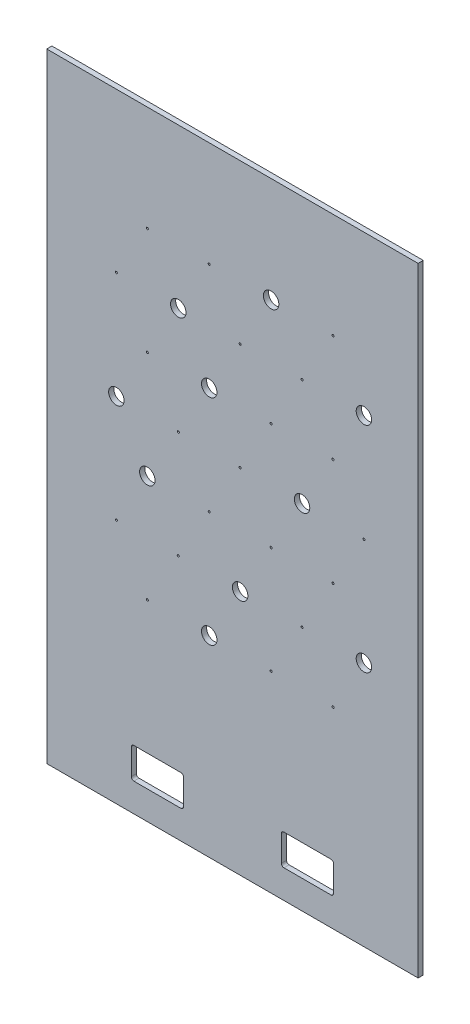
ISO-10303-21;
HEADER;
FILE_DESCRIPTION(('STEP AP214'),'2;1');
FILE_NAME('part.step','',(''),(''),'','','');
FILE_SCHEMA(('AUTOMOTIVE_DESIGN { 1 0 10303 214 1 1 1 1 }'));
ENDSEC;
DATA;
#1=APPLICATION_CONTEXT('core data for automotive mechanical design processes');
#2=APPLICATION_PROTOCOL_DEFINITION('international standard','automotive_design',2000,#1);
#3=PRODUCT_CONTEXT('',#1,'mechanical');
#4=PRODUCT('Part','Part','',(#3));
#5=PRODUCT_RELATED_PRODUCT_CATEGORY('part','',(#4));
#6=PRODUCT_DEFINITION_FORMATION('','',#4);
#7=PRODUCT_DEFINITION_CONTEXT('part definition',#1,'design');
#8=PRODUCT_DEFINITION('design','',#6,#7);
#9=PRODUCT_DEFINITION_SHAPE('','',#8);
#10=(LENGTH_UNIT() NAMED_UNIT(*) SI_UNIT(.MILLI.,.METRE.));
#11=(NAMED_UNIT(*) PLANE_ANGLE_UNIT() SI_UNIT($,.RADIAN.));
#12=(NAMED_UNIT(*) SI_UNIT($,.STERADIAN.) SOLID_ANGLE_UNIT());
#13=UNCERTAINTY_MEASURE_WITH_UNIT(LENGTH_MEASURE(1.E-05),#10,'distance_accuracy_value','');
#14=(GEOMETRIC_REPRESENTATION_CONTEXT(3) GLOBAL_UNCERTAINTY_ASSIGNED_CONTEXT((#13)) GLOBAL_UNIT_ASSIGNED_CONTEXT((#10,
#11,#12)) REPRESENTATION_CONTEXT('',''));
#15=CARTESIAN_POINT('',(0.,0.,0.));
#16=DIRECTION('',(0.,0.,1.));
#17=DIRECTION('',(1.,0.,0.));
#18=AXIS2_PLACEMENT_3D('',#15,#16,#17);
#19=CARTESIAN_POINT('',(457.2,-609.6,6.35));
#20=DIRECTION('',(-1.,0.,0.));
#21=DIRECTION('',(0.,0.,1.));
#22=AXIS2_PLACEMENT_3D('',#19,#20,#21);
#23=PLANE('',#22);
#24=DIRECTION('',(0.,1.,0.));
#25=VECTOR('',#24,1.);
#26=CARTESIAN_POINT('',(457.2,-609.6,-6.35));
#27=LINE('',#26,#25);
#28=CARTESIAN_POINT('',(457.2,-787.4,-6.35));
#29=VERTEX_POINT('',#28);
#30=CARTESIAN_POINT('',(457.2,736.6,-6.35));
#31=VERTEX_POINT('',#30);
#32=EDGE_CURVE('E390',#29,#31,#27,.T.);
#33=ORIENTED_EDGE('',*,*,#32,.T.);
#34=DIRECTION('',(0.,0.,-1.));
#35=VECTOR('',#34,1.);
#36=CARTESIAN_POINT('',(457.2,736.6,6.35));
#37=LINE('',#36,#35);
#38=CARTESIAN_POINT('',(457.2,736.6,6.35));
#39=VERTEX_POINT('',#38);
#40=EDGE_CURVE('E199',#39,#31,#37,.T.);
#41=ORIENTED_EDGE('',*,*,#40,.F.);
#42=DIRECTION('',(0.,1.,0.));
#43=VECTOR('',#42,1.);
#44=CARTESIAN_POINT('',(457.2,-609.6,6.35));
#45=LINE('',#44,#43);
#46=CARTESIAN_POINT('',(457.2,-787.4,6.35));
#47=VERTEX_POINT('',#46);
#48=EDGE_CURVE('E191',#47,#39,#45,.T.);
#49=ORIENTED_EDGE('',*,*,#48,.F.);
#50=DIRECTION('',(0.,0.,-1.));
#51=VECTOR('',#50,1.);
#52=CARTESIAN_POINT('',(457.2,-787.4,-6.35));
#53=LINE('',#52,#51);
#54=EDGE_CURVE('E258',#47,#29,#53,.T.);
#55=ORIENTED_EDGE('',*,*,#54,.T.);
#56=EDGE_LOOP('',(#33,#41,#49,#55));
#57=FACE_BOUND('',#56,.T.);
#58=ADVANCED_FACE('F41',(#57),#23,.F.);
#59=CARTESIAN_POINT('',(-457.2,-609.6,6.35));
#60=DIRECTION('',(1.,0.,0.));
#61=DIRECTION('',(0.,0.,-1.));
#62=AXIS2_PLACEMENT_3D('',#59,#60,#61);
#63=PLANE('',#62);
#64=DIRECTION('',(0.,-1.,0.));
#65=VECTOR('',#64,1.);
#66=CARTESIAN_POINT('',(-457.2,-609.6,-6.35));
#67=LINE('',#66,#65);
#68=CARTESIAN_POINT('',(-457.2,736.6,-6.35));
#69=VERTEX_POINT('',#68);
#70=CARTESIAN_POINT('',(-457.2,-787.4,-6.35));
#71=VERTEX_POINT('',#70);
#72=EDGE_CURVE('E393',#69,#71,#67,.T.);
#73=ORIENTED_EDGE('',*,*,#72,.T.);
#74=DIRECTION('',(0.,0.,1.));
#75=VECTOR('',#74,1.);
#76=CARTESIAN_POINT('',(-457.2,-787.4,6.35));
#77=LINE('',#76,#75);
#78=CARTESIAN_POINT('',(-457.2,-787.4,6.35));
#79=VERTEX_POINT('',#78);
#80=EDGE_CURVE('E186',#71,#79,#77,.T.);
#81=ORIENTED_EDGE('',*,*,#80,.T.);
#82=DIRECTION('',(0.,-1.,0.));
#83=VECTOR('',#82,1.);
#84=CARTESIAN_POINT('',(-457.2,-609.6,6.35));
#85=LINE('',#84,#83);
#86=CARTESIAN_POINT('',(-457.2,736.6,6.35));
#87=VERTEX_POINT('',#86);
#88=EDGE_CURVE('E179',#87,#79,#85,.T.);
#89=ORIENTED_EDGE('',*,*,#88,.F.);
#90=DIRECTION('',(0.,0.,1.));
#91=VECTOR('',#90,1.);
#92=CARTESIAN_POINT('',(-457.2,736.6,-6.35));
#93=LINE('',#92,#91);
#94=EDGE_CURVE('E183',#69,#87,#93,.T.);
#95=ORIENTED_EDGE('',*,*,#94,.F.);
#96=EDGE_LOOP('',(#73,#81,#89,#95));
#97=FACE_BOUND('',#96,.T.);
#98=ADVANCED_FACE('F181',(#97),#63,.F.);
#99=CARTESIAN_POINT('',(0.,0.,6.35));
#100=DIRECTION('',(0.,0.,-1.));
#101=DIRECTION('',(-1.,0.,0.));
#102=AXIS2_PLACEMENT_3D('',#99,#100,#101);
#103=PLANE('',#102);
#104=CARTESIAN_POINT('',(95.249999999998,477.617728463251,6.35));
#105=DIRECTION('',(0.,0.,1.));
#106=DIRECTION('',(1.,0.,0.));
#107=AXIS2_PLACEMENT_3D('',#104,#105,#106);
#108=CIRCLE('',#107,19.05);
#109=CARTESIAN_POINT('',(114.299999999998,477.617728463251,6.35));
#110=VERTEX_POINT('',#109);
#111=EDGE_CURVE('E834',#110,#110,#108,.T.);
#112=ORIENTED_EDGE('',*,*,#111,.F.);
#113=EDGE_LOOP('',(#112));
#114=FACE_BOUND('',#113,.T.);
#115=CARTESIAN_POINT('',(323.849999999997,-182.293629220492,6.35));
#116=DIRECTION('',(0.,0.,1.));
#117=DIRECTION('',(1.,0.,0.));
#118=AXIS2_PLACEMENT_3D('',#115,#116,#117);
#119=CIRCLE('',#118,19.05);
#120=CARTESIAN_POINT('',(342.899999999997,-182.293629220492,6.35));
#121=VERTEX_POINT('',#120);
#122=EDGE_CURVE('E819',#121,#121,#119,.T.);
#123=ORIENTED_EDGE('',*,*,#122,.F.);
#124=EDGE_LOOP('',(#123));
#125=FACE_BOUND('',#124,.T.);
#126=CARTESIAN_POINT('',(-57.1500000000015,-314.275900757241,6.35));
#127=DIRECTION('',(0.,0.,1.));
#128=DIRECTION('',(1.,0.,0.));
#129=AXIS2_PLACEMENT_3D('',#126,#127,#128);
#130=CIRCLE('',#129,19.05);
#131=CARTESIAN_POINT('',(-38.1000000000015,-314.275900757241,6.35));
#132=VERTEX_POINT('',#131);
#133=EDGE_CURVE('E836',#132,#132,#130,.T.);
#134=ORIENTED_EDGE('',*,*,#133,.F.);
#135=EDGE_LOOP('',(#134));
#136=FACE_BOUND('',#135,.T.);
#137=CARTESIAN_POINT('',(19.0499999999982,-182.293629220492,6.35));
#138=DIRECTION('',(0.,0.,1.));
#139=DIRECTION('',(1.,0.,0.));
#140=AXIS2_PLACEMENT_3D('',#137,#138,#139);
#141=CIRCLE('',#140,19.05);
#142=CARTESIAN_POINT('',(38.0999999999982,-182.293629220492,6.35));
#143=VERTEX_POINT('',#142);
#144=EDGE_CURVE('E837',#143,#143,#141,.T.);
#145=ORIENTED_EDGE('',*,*,#144,.F.);
#146=EDGE_LOOP('',(#145));
#147=FACE_BOUND('',#146,.T.);
#148=CARTESIAN_POINT('',(-57.1500000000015,213.653185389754,6.35));
#149=DIRECTION('',(0.,0.,1.));
#150=DIRECTION('',(1.,0.,0.));
#151=AXIS2_PLACEMENT_3D('',#148,#149,#150);
#152=CIRCLE('',#151,19.05);
#153=CARTESIAN_POINT('',(-38.1000000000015,213.653185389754,6.35));
#154=VERTEX_POINT('',#153);
#155=EDGE_CURVE('E814',#154,#154,#152,.T.);
#156=ORIENTED_EDGE('',*,*,#155,.F.);
#157=EDGE_LOOP('',(#156));
#158=FACE_BOUND('',#157,.T.);
#159=CARTESIAN_POINT('',(171.449999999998,81.6709138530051,6.35));
#160=DIRECTION('',(0.,0.,1.));
#161=DIRECTION('',(1.,0.,0.));
#162=AXIS2_PLACEMENT_3D('',#159,#160,#161);
#163=CIRCLE('',#162,19.05);
#164=CARTESIAN_POINT('',(190.499999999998,81.6709138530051,6.35));
#165=VERTEX_POINT('',#164);
#166=EDGE_CURVE('E818',#165,#165,#163,.T.);
#167=ORIENTED_EDGE('',*,*,#166,.F.);
#168=EDGE_LOOP('',(#167));
#169=FACE_BOUND('',#168,.T.);
#170=CARTESIAN_POINT('',(-209.550000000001,-50.3113576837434,6.35));
#171=DIRECTION('',(0.,0.,1.));
#172=DIRECTION('',(1.,0.,0.));
#173=AXIS2_PLACEMENT_3D('',#170,#171,#172);
#174=CIRCLE('',#173,19.05);
#175=CARTESIAN_POINT('',(-190.500000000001,-50.3113576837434,6.35));
#176=VERTEX_POINT('',#175);
#177=EDGE_CURVE('E823',#176,#176,#174,.T.);
#178=ORIENTED_EDGE('',*,*,#177,.F.);
#179=EDGE_LOOP('',(#178));
#180=FACE_BOUND('',#179,.T.);
#181=CARTESIAN_POINT('',(323.849999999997,345.635456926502,6.35));
#182=DIRECTION('',(0.,0.,1.));
#183=DIRECTION('',(1.,0.,0.));
#184=AXIS2_PLACEMENT_3D('',#181,#182,#183);
#185=CIRCLE('',#184,19.05);
#186=CARTESIAN_POINT('',(342.899999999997,345.635456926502,6.35));
#187=VERTEX_POINT('',#186);
#188=EDGE_CURVE('E827',#187,#187,#185,.T.);
#189=ORIENTED_EDGE('',*,*,#188,.F.);
#190=EDGE_LOOP('',(#189));
#191=FACE_BOUND('',#190,.T.);
#192=CARTESIAN_POINT('',(-133.350000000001,345.635456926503,6.35));
#193=DIRECTION('',(0.,0.,1.));
#194=DIRECTION('',(1.,0.,0.));
#195=AXIS2_PLACEMENT_3D('',#192,#193,#194);
#196=CIRCLE('',#195,19.05);
#197=CARTESIAN_POINT('',(-114.300000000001,345.635456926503,6.35));
#198=VERTEX_POINT('',#197);
#199=EDGE_CURVE('E831',#198,#198,#196,.T.);
#200=ORIENTED_EDGE('',*,*,#199,.F.);
#201=EDGE_LOOP('',(#200));
#202=FACE_BOUND('',#201,.T.);
#203=CARTESIAN_POINT('',(-285.750000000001,81.6709138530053,6.35));
#204=DIRECTION('',(0.,0.,1.));
#205=DIRECTION('',(1.,0.,0.));
#206=AXIS2_PLACEMENT_3D('',#203,#204,#205);
#207=CIRCLE('',#206,19.05);
#208=CARTESIAN_POINT('',(-266.700000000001,81.6709138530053,6.35));
#209=VERTEX_POINT('',#208);
#210=EDGE_CURVE('E810',#209,#209,#207,.T.);
#211=ORIENTED_EDGE('',*,*,#210,.F.);
#212=EDGE_LOOP('',(#211));
#213=FACE_BOUND('',#212,.T.);
#214=DIRECTION('',(-1.,0.,0.));
#215=VECTOR('',#214,1.);
#216=CARTESIAN_POINT('',(-249.0978,-641.35,6.35));
#217=LINE('',#216,#215);
#218=CARTESIAN_POINT('',(-126.868483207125,-641.35,6.35));
#219=VERTEX_POINT('',#218);
#220=CARTESIAN_POINT('',(-242.7478,-641.35,6.35));
#221=VERTEX_POINT('',#220);
#222=EDGE_CURVE('E231',#219,#221,#217,.T.);
#223=ORIENTED_EDGE('',*,*,#222,.F.);
#224=CARTESIAN_POINT('',(-126.868483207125,-647.7,6.35));
#225=DIRECTION('',(0.,0.,-1.));
#226=DIRECTION('',(-1.,0.,0.));
#227=AXIS2_PLACEMENT_3D('',#224,#225,#226);
#228=CIRCLE('',#227,6.35);
#229=CARTESIAN_POINT('',(-120.518483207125,-647.7,6.35));
#230=VERTEX_POINT('',#229);
#231=EDGE_CURVE('E459',#219,#230,#228,.T.);
#232=ORIENTED_EDGE('',*,*,#231,.T.);
#233=DIRECTION('',(0.,1.,0.));
#234=VECTOR('',#233,1.);
#235=CARTESIAN_POINT('',(-120.518483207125,-641.35,6.35));
#236=LINE('',#235,#234);
#237=CARTESIAN_POINT('',(-120.518483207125,-711.2,6.35));
#238=VERTEX_POINT('',#237);
#239=EDGE_CURVE('E228',#238,#230,#236,.T.);
#240=ORIENTED_EDGE('',*,*,#239,.F.);
#241=CARTESIAN_POINT('',(-126.868483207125,-711.2,6.35));
#242=DIRECTION('',(0.,0.,-1.));
#243=DIRECTION('',(-1.,0.,0.));
#244=AXIS2_PLACEMENT_3D('',#241,#242,#243);
#245=CIRCLE('',#244,6.35);
#246=CARTESIAN_POINT('',(-126.868483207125,-717.55,6.35));
#247=VERTEX_POINT('',#246);
#248=EDGE_CURVE('E455',#238,#247,#245,.T.);
#249=ORIENTED_EDGE('',*,*,#248,.T.);
#250=DIRECTION('',(1.,0.,0.));
#251=VECTOR('',#250,1.);
#252=CARTESIAN_POINT('',(-249.0978,-717.55,6.35));
#253=LINE('',#252,#251);
#254=CARTESIAN_POINT('',(-242.7478,-717.55,6.35));
#255=VERTEX_POINT('',#254);
#256=EDGE_CURVE('E219',#255,#247,#253,.T.);
#257=ORIENTED_EDGE('',*,*,#256,.F.);
#258=CARTESIAN_POINT('',(-242.7478,-711.2,6.35));
#259=DIRECTION('',(0.,0.,-1.));
#260=DIRECTION('',(-1.,0.,0.));
#261=AXIS2_PLACEMENT_3D('',#258,#259,#260);
#262=CIRCLE('',#261,6.35);
#263=CARTESIAN_POINT('',(-249.0978,-711.2,6.35));
#264=VERTEX_POINT('',#263);
#265=EDGE_CURVE('E451',#255,#264,#262,.T.);
#266=ORIENTED_EDGE('',*,*,#265,.T.);
#267=DIRECTION('',(0.,-1.,0.));
#268=VECTOR('',#267,1.);
#269=CARTESIAN_POINT('',(-249.0978,-641.35,6.35));
#270=LINE('',#269,#268);
#271=CARTESIAN_POINT('',(-249.0978,-647.7,6.35));
#272=VERTEX_POINT('',#271);
#273=EDGE_CURVE('E234',#272,#264,#270,.T.);
#274=ORIENTED_EDGE('',*,*,#273,.F.);
#275=CARTESIAN_POINT('',(-242.7478,-647.7,6.35));
#276=DIRECTION('',(0.,0.,-1.));
#277=DIRECTION('',(-1.,0.,0.));
#278=AXIS2_PLACEMENT_3D('',#275,#276,#277);
#279=CIRCLE('',#278,6.35);
#280=EDGE_CURVE('E49',#272,#221,#279,.T.);
#281=ORIENTED_EDGE('',*,*,#280,.T.);
#282=EDGE_LOOP('',(#223,#232,#240,#249,#257,#266,#274,#281));
#283=FACE_BOUND('',#282,.T.);
#284=DIRECTION('',(0.,-1.,0.));
#285=VECTOR('',#284,1.);
#286=CARTESIAN_POINT('',(120.518483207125,-641.35,6.35));
#287=LINE('',#286,#285);
#288=CARTESIAN_POINT('',(120.518483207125,-647.7,6.35));
#289=VERTEX_POINT('',#288);
#290=CARTESIAN_POINT('',(120.518483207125,-711.2,6.35));
#291=VERTEX_POINT('',#290);
#292=EDGE_CURVE('E246',#289,#291,#287,.T.);
#293=ORIENTED_EDGE('',*,*,#292,.F.);
#294=CARTESIAN_POINT('',(126.868483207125,-647.7,6.35));
#295=DIRECTION('',(0.,0.,-1.));
#296=DIRECTION('',(-1.,0.,0.));
#297=AXIS2_PLACEMENT_3D('',#294,#295,#296);
#298=CIRCLE('',#297,6.35);
#299=CARTESIAN_POINT('',(126.868483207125,-641.35,6.35));
#300=VERTEX_POINT('',#299);
#301=EDGE_CURVE('E443',#289,#300,#298,.T.);
#302=ORIENTED_EDGE('',*,*,#301,.T.);
#303=DIRECTION('',(-1.,0.,0.));
#304=VECTOR('',#303,1.);
#305=CARTESIAN_POINT('',(249.0978,-641.35,6.35));
#306=LINE('',#305,#304);
#307=CARTESIAN_POINT('',(242.7478,-641.35,6.35));
#308=VERTEX_POINT('',#307);
#309=EDGE_CURVE('E232',#308,#300,#306,.T.);
#310=ORIENTED_EDGE('',*,*,#309,.F.);
#311=CARTESIAN_POINT('',(242.7478,-647.7,6.35));
#312=DIRECTION('',(0.,0.,-1.));
#313=DIRECTION('',(-1.,0.,0.));
#314=AXIS2_PLACEMENT_3D('',#311,#312,#313);
#315=CIRCLE('',#314,6.35);
#316=CARTESIAN_POINT('',(249.0978,-647.7,6.35));
#317=VERTEX_POINT('',#316);
#318=EDGE_CURVE('E439',#308,#317,#315,.T.);
#319=ORIENTED_EDGE('',*,*,#318,.T.);
#320=DIRECTION('',(0.,1.,0.));
#321=VECTOR('',#320,1.);
#322=CARTESIAN_POINT('',(249.0978,-641.35,6.35));
#323=LINE('',#322,#321);
#324=CARTESIAN_POINT('',(249.0978,-711.2,6.35));
#325=VERTEX_POINT('',#324);
#326=EDGE_CURVE('E239',#325,#317,#323,.T.);
#327=ORIENTED_EDGE('',*,*,#326,.F.);
#328=CARTESIAN_POINT('',(242.7478,-711.2,6.35));
#329=DIRECTION('',(0.,0.,-1.));
#330=DIRECTION('',(-1.,0.,0.));
#331=AXIS2_PLACEMENT_3D('',#328,#329,#330);
#332=CIRCLE('',#331,6.35);
#333=CARTESIAN_POINT('',(242.7478,-717.55,6.35));
#334=VERTEX_POINT('',#333);
#335=EDGE_CURVE('E435',#325,#334,#332,.T.);
#336=ORIENTED_EDGE('',*,*,#335,.T.);
#337=DIRECTION('',(1.,0.,0.));
#338=VECTOR('',#337,1.);
#339=CARTESIAN_POINT('',(249.0978,-717.55,6.35));
#340=LINE('',#339,#338);
#341=CARTESIAN_POINT('',(126.868483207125,-717.55,6.35));
#342=VERTEX_POINT('',#341);
#343=EDGE_CURVE('E242',#342,#334,#340,.T.);
#344=ORIENTED_EDGE('',*,*,#343,.F.);
#345=CARTESIAN_POINT('',(126.868483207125,-711.2,6.35));
#346=DIRECTION('',(0.,0.,-1.));
#347=DIRECTION('',(-1.,0.,0.));
#348=AXIS2_PLACEMENT_3D('',#345,#346,#347);
#349=CIRCLE('',#348,6.35);
#350=EDGE_CURVE('E447',#342,#291,#349,.T.);
#351=ORIENTED_EDGE('',*,*,#350,.T.);
#352=EDGE_LOOP('',(#293,#302,#310,#319,#327,#336,#344,#351));
#353=FACE_BOUND('',#352,.T.);
#354=CARTESIAN_POINT('',(-133.350000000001,-182.293629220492,6.35));
#355=DIRECTION('',(0.,0.,1.));
#356=DIRECTION('',(1.,0.,0.));
#357=AXIS2_PLACEMENT_3D('',#354,#355,#356);
#358=CIRCLE('',#357,2.54);
#359=CARTESIAN_POINT('',(-130.810000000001,-182.293629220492,6.35));
#360=VERTEX_POINT('',#359);
#361=EDGE_CURVE('E343',#360,#360,#358,.T.);
#362=ORIENTED_EDGE('',*,*,#361,.F.);
#363=EDGE_LOOP('',(#362));
#364=FACE_BOUND('',#363,.T.);
#365=CARTESIAN_POINT('',(171.449999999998,-182.293629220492,6.35));
#366=DIRECTION('',(0.,0.,1.));
#367=DIRECTION('',(1.,0.,0.));
#368=AXIS2_PLACEMENT_3D('',#365,#366,#367);
#369=CIRCLE('',#368,2.54);
#370=CARTESIAN_POINT('',(173.989999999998,-182.293629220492,6.35));
#371=VERTEX_POINT('',#370);
#372=EDGE_CURVE('E330',#371,#371,#369,.T.);
#373=ORIENTED_EDGE('',*,*,#372,.F.);
#374=EDGE_LOOP('',(#373));
#375=FACE_BOUND('',#374,.T.);
#376=CARTESIAN_POINT('',(-57.1500000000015,-50.3113576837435,6.35));
#377=DIRECTION('',(0.,0.,1.));
#378=DIRECTION('',(1.,0.,0.));
#379=AXIS2_PLACEMENT_3D('',#376,#377,#378);
#380=CIRCLE('',#379,2.54);
#381=CARTESIAN_POINT('',(-54.6100000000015,-50.3113576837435,6.35));
#382=VERTEX_POINT('',#381);
#383=EDGE_CURVE('E312',#382,#382,#380,.T.);
#384=ORIENTED_EDGE('',*,*,#383,.F.);
#385=EDGE_LOOP('',(#384));
#386=FACE_BOUND('',#385,.T.);
#387=CARTESIAN_POINT('',(-133.350000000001,81.6709138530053,6.35));
#388=DIRECTION('',(0.,0.,1.));
#389=DIRECTION('',(1.,0.,0.));
#390=AXIS2_PLACEMENT_3D('',#387,#388,#389);
#391=CIRCLE('',#390,2.54);
#392=CARTESIAN_POINT('',(-130.810000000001,81.6709138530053,6.35));
#393=VERTEX_POINT('',#392);
#394=EDGE_CURVE('E331',#393,#393,#391,.T.);
#395=ORIENTED_EDGE('',*,*,#394,.F.);
#396=EDGE_LOOP('',(#395));
#397=FACE_BOUND('',#396,.T.);
#398=CARTESIAN_POINT('',(-285.750000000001,-182.293629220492,6.35));
#399=DIRECTION('',(0.,0.,1.));
#400=DIRECTION('',(1.,0.,0.));
#401=AXIS2_PLACEMENT_3D('',#398,#399,#400);
#402=CIRCLE('',#401,2.54);
#403=CARTESIAN_POINT('',(-283.210000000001,-182.293629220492,6.35));
#404=VERTEX_POINT('',#403);
#405=EDGE_CURVE('E379',#404,#404,#402,.T.);
#406=ORIENTED_EDGE('',*,*,#405,.F.);
#407=EDGE_LOOP('',(#406));
#408=FACE_BOUND('',#407,.T.);
#409=CARTESIAN_POINT('',(-209.550000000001,-314.275900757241,6.35));
#410=DIRECTION('',(0.,0.,1.));
#411=DIRECTION('',(1.,0.,0.));
#412=AXIS2_PLACEMENT_3D('',#409,#410,#411);
#413=CIRCLE('',#412,2.54);
#414=CARTESIAN_POINT('',(-207.010000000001,-314.275900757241,6.35));
#415=VERTEX_POINT('',#414);
#416=EDGE_CURVE('E354',#415,#415,#413,.T.);
#417=ORIENTED_EDGE('',*,*,#416,.F.);
#418=EDGE_LOOP('',(#417));
#419=FACE_BOUND('',#418,.T.);
#420=CARTESIAN_POINT('',(95.249999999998,-314.275900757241,6.35));
#421=DIRECTION('',(0.,0.,1.));
#422=DIRECTION('',(1.,0.,0.));
#423=AXIS2_PLACEMENT_3D('',#420,#421,#422);
#424=CIRCLE('',#423,2.54);
#425=CARTESIAN_POINT('',(97.7899999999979,-314.275900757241,6.35));
#426=VERTEX_POINT('',#425);
#427=EDGE_CURVE('E355',#426,#426,#424,.T.);
#428=ORIENTED_EDGE('',*,*,#427,.F.);
#429=EDGE_LOOP('',(#428));
#430=FACE_BOUND('',#429,.T.);
#431=CARTESIAN_POINT('',(247.649999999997,-314.275900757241,6.35));
#432=DIRECTION('',(0.,0.,1.));
#433=DIRECTION('',(1.,0.,0.));
#434=AXIS2_PLACEMENT_3D('',#431,#432,#433);
#435=CIRCLE('',#434,2.54);
#436=CARTESIAN_POINT('',(250.189999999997,-314.275900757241,6.35));
#437=VERTEX_POINT('',#436);
#438=EDGE_CURVE('E361',#437,#437,#435,.T.);
#439=ORIENTED_EDGE('',*,*,#438,.F.);
#440=EDGE_LOOP('',(#439));
#441=FACE_BOUND('',#440,.T.);
#442=CARTESIAN_POINT('',(-209.550000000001,477.617728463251,6.35));
#443=DIRECTION('',(0.,0.,1.));
#444=DIRECTION('',(1.,0.,0.));
#445=AXIS2_PLACEMENT_3D('',#442,#443,#444);
#446=CIRCLE('',#445,2.54);
#447=CARTESIAN_POINT('',(-207.010000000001,477.617728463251,6.35));
#448=VERTEX_POINT('',#447);
#449=EDGE_CURVE('E367',#448,#448,#446,.T.);
#450=ORIENTED_EDGE('',*,*,#449,.F.);
#451=EDGE_LOOP('',(#450));
#452=FACE_BOUND('',#451,.T.);
#453=CARTESIAN_POINT('',(-209.550000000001,213.653185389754,6.35));
#454=DIRECTION('',(0.,0.,1.));
#455=DIRECTION('',(1.,0.,0.));
#456=AXIS2_PLACEMENT_3D('',#453,#454,#455);
#457=CIRCLE('',#456,2.54);
#458=CARTESIAN_POINT('',(-207.010000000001,213.653185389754,6.35));
#459=VERTEX_POINT('',#458);
#460=EDGE_CURVE('E342',#459,#459,#457,.T.);
#461=ORIENTED_EDGE('',*,*,#460,.F.);
#462=EDGE_LOOP('',(#461));
#463=FACE_BOUND('',#462,.T.);
#464=CARTESIAN_POINT('',(95.249999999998,213.653185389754,6.35));
#465=DIRECTION('',(0.,0.,1.));
#466=DIRECTION('',(1.,0.,0.));
#467=AXIS2_PLACEMENT_3D('',#464,#465,#466);
#468=CIRCLE('',#467,2.54);
#469=CARTESIAN_POINT('',(97.7899999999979,213.653185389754,6.35));
#470=VERTEX_POINT('',#469);
#471=EDGE_CURVE('E277',#470,#470,#468,.T.);
#472=ORIENTED_EDGE('',*,*,#471,.F.);
#473=EDGE_LOOP('',(#472));
#474=FACE_BOUND('',#473,.T.);
#475=CARTESIAN_POINT('',(247.649999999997,213.653185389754,6.35));
#476=DIRECTION('',(0.,0.,1.));
#477=DIRECTION('',(1.,0.,0.));
#478=AXIS2_PLACEMENT_3D('',#475,#476,#477);
#479=CIRCLE('',#478,2.54);
#480=CARTESIAN_POINT('',(250.189999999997,213.653185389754,6.35));
#481=VERTEX_POINT('',#480);
#482=EDGE_CURVE('E283',#481,#481,#479,.T.);
#483=ORIENTED_EDGE('',*,*,#482,.F.);
#484=EDGE_LOOP('',(#483));
#485=FACE_BOUND('',#484,.T.);
#486=CARTESIAN_POINT('',(171.449999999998,345.635456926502,6.35));
#487=DIRECTION('',(0.,0.,1.));
#488=DIRECTION('',(1.,0.,0.));
#489=AXIS2_PLACEMENT_3D('',#486,#487,#488);
#490=CIRCLE('',#489,2.54);
#491=CARTESIAN_POINT('',(173.989999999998,345.635456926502,6.35));
#492=VERTEX_POINT('',#491);
#493=EDGE_CURVE('E270',#492,#492,#490,.T.);
#494=ORIENTED_EDGE('',*,*,#493,.F.);
#495=EDGE_LOOP('',(#494));
#496=FACE_BOUND('',#495,.T.);
#497=CARTESIAN_POINT('',(247.649999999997,477.617728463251,6.35));
#498=DIRECTION('',(0.,0.,1.));
#499=DIRECTION('',(1.,0.,0.));
#500=AXIS2_PLACEMENT_3D('',#497,#498,#499);
#501=CIRCLE('',#500,2.54);
#502=CARTESIAN_POINT('',(250.189999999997,477.617728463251,6.35));
#503=VERTEX_POINT('',#502);
#504=EDGE_CURVE('E265',#503,#503,#501,.T.);
#505=ORIENTED_EDGE('',*,*,#504,.F.);
#506=EDGE_LOOP('',(#505));
#507=FACE_BOUND('',#506,.T.);
#508=CARTESIAN_POINT('',(95.249999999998,-50.3113576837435,6.35));
#509=DIRECTION('',(0.,0.,1.));
#510=DIRECTION('',(1.,0.,0.));
#511=AXIS2_PLACEMENT_3D('',#508,#509,#510);
#512=CIRCLE('',#511,2.54);
#513=CARTESIAN_POINT('',(97.7899999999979,-50.3113576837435,6.35));
#514=VERTEX_POINT('',#513);
#515=EDGE_CURVE('E313',#514,#514,#512,.T.);
#516=ORIENTED_EDGE('',*,*,#515,.F.);
#517=EDGE_LOOP('',(#516));
#518=FACE_BOUND('',#517,.T.);
#519=CARTESIAN_POINT('',(247.649999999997,-50.3113576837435,6.35));
#520=DIRECTION('',(0.,0.,1.));
#521=DIRECTION('',(1.,0.,0.));
#522=AXIS2_PLACEMENT_3D('',#519,#520,#521);
#523=CIRCLE('',#522,2.54);
#524=CARTESIAN_POINT('',(250.189999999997,-50.3113576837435,6.35));
#525=VERTEX_POINT('',#524);
#526=EDGE_CURVE('E319',#525,#525,#523,.T.);
#527=ORIENTED_EDGE('',*,*,#526,.F.);
#528=EDGE_LOOP('',(#527));
#529=FACE_BOUND('',#528,.T.);
#530=CARTESIAN_POINT('',(-57.1500000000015,477.617728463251,6.35));
#531=DIRECTION('',(0.,0.,1.));
#532=DIRECTION('',(1.,0.,0.));
#533=AXIS2_PLACEMENT_3D('',#530,#531,#532);
#534=CIRCLE('',#533,2.54);
#535=CARTESIAN_POINT('',(-54.6100000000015,477.617728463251,6.35));
#536=VERTEX_POINT('',#535);
#537=EDGE_CURVE('E306',#536,#536,#534,.T.);
#538=ORIENTED_EDGE('',*,*,#537,.F.);
#539=EDGE_LOOP('',(#538));
#540=FACE_BOUND('',#539,.T.);
#541=CARTESIAN_POINT('',(19.0499999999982,345.635456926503,6.35));
#542=DIRECTION('',(0.,0.,1.));
#543=DIRECTION('',(1.,0.,0.));
#544=AXIS2_PLACEMENT_3D('',#541,#542,#543);
#545=CIRCLE('',#544,2.54);
#546=CARTESIAN_POINT('',(21.5899999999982,345.635456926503,6.35));
#547=VERTEX_POINT('',#546);
#548=EDGE_CURVE('E276',#547,#547,#545,.T.);
#549=ORIENTED_EDGE('',*,*,#548,.F.);
#550=EDGE_LOOP('',(#549));
#551=FACE_BOUND('',#550,.T.);
#552=CARTESIAN_POINT('',(323.849999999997,81.6709138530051,6.35));
#553=DIRECTION('',(0.,0.,1.));
#554=DIRECTION('',(1.,0.,0.));
#555=AXIS2_PLACEMENT_3D('',#552,#553,#554);
#556=CIRCLE('',#555,2.54);
#557=CARTESIAN_POINT('',(326.389999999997,81.6709138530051,6.35));
#558=VERTEX_POINT('',#557);
#559=EDGE_CURVE('E295',#558,#558,#556,.T.);
#560=ORIENTED_EDGE('',*,*,#559,.F.);
#561=EDGE_LOOP('',(#560));
#562=FACE_BOUND('',#561,.T.);
#563=CARTESIAN_POINT('',(19.0499999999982,81.6709138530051,6.35));
#564=DIRECTION('',(0.,0.,1.));
#565=DIRECTION('',(1.,0.,0.));
#566=AXIS2_PLACEMENT_3D('',#563,#564,#565);
#567=CIRCLE('',#566,2.54);
#568=CARTESIAN_POINT('',(21.5899999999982,81.6709138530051,6.35));
#569=VERTEX_POINT('',#568);
#570=EDGE_CURVE('E294',#569,#569,#567,.T.);
#571=ORIENTED_EDGE('',*,*,#570,.F.);
#572=EDGE_LOOP('',(#571));
#573=FACE_BOUND('',#572,.T.);
#574=CARTESIAN_POINT('',(-285.750000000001,345.635456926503,6.35));
#575=DIRECTION('',(0.,0.,1.));
#576=DIRECTION('',(1.,0.,0.));
#577=AXIS2_PLACEMENT_3D('',#574,#575,#576);
#578=CIRCLE('',#577,2.54);
#579=CARTESIAN_POINT('',(-283.210000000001,345.635456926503,6.35));
#580=VERTEX_POINT('',#579);
#581=EDGE_CURVE('E378',#580,#580,#578,.T.);
#582=ORIENTED_EDGE('',*,*,#581,.F.);
#583=EDGE_LOOP('',(#582));
#584=FACE_BOUND('',#583,.T.);
#585=ORIENTED_EDGE('',*,*,#48,.T.);
#586=DIRECTION('',(1.,0.,0.));
#587=VECTOR('',#586,1.);
#588=CARTESIAN_POINT('',(-457.2,736.6,6.35));
#589=LINE('',#588,#587);
#590=EDGE_CURVE('E194',#87,#39,#589,.T.);
#591=ORIENTED_EDGE('',*,*,#590,.F.);
#592=ORIENTED_EDGE('',*,*,#88,.T.);
#593=DIRECTION('',(1.,0.,0.));
#594=VECTOR('',#593,1.);
#595=CARTESIAN_POINT('',(457.2,-787.4,6.35));
#596=LINE('',#595,#594);
#597=EDGE_CURVE('E227',#79,#47,#596,.T.);
#598=ORIENTED_EDGE('',*,*,#597,.T.);
#599=EDGE_LOOP('',(#585,#591,#592,#598));
#600=FACE_BOUND('',#599,.T.);
#601=ADVANCED_FACE('F195',(#114,#125,#136,#147,#158,#169,#180,#191,#202,#213,#283,#353,#364,
#375,#386,#397,#408,#419,#430,#441,#452,#463,#474,#485,#496,#507,#518,#529,#540,#551,#562,#573,
#584,#600),#103,.F.);
#602=CARTESIAN_POINT('',(0.,0.,-6.35));
#603=DIRECTION('',(0.,0.,-1.));
#604=DIRECTION('',(-1.,0.,0.));
#605=AXIS2_PLACEMENT_3D('',#602,#603,#604);
#606=PLANE('',#605);
#607=CARTESIAN_POINT('',(95.249999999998,477.617728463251,-6.35));
#608=DIRECTION('',(0.,0.,1.));
#609=DIRECTION('',(1.,0.,0.));
#610=AXIS2_PLACEMENT_3D('',#607,#608,#609);
#611=CIRCLE('',#610,19.05);
#612=CARTESIAN_POINT('',(114.299999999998,477.617728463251,-6.35));
#613=VERTEX_POINT('',#612);
#614=EDGE_CURVE('E200',#613,#613,#611,.T.);
#615=ORIENTED_EDGE('',*,*,#614,.T.);
#616=EDGE_LOOP('',(#615));
#617=FACE_BOUND('',#616,.T.);
#618=CARTESIAN_POINT('',(323.849999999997,-182.293629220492,-6.35));
#619=DIRECTION('',(0.,0.,1.));
#620=DIRECTION('',(1.,0.,0.));
#621=AXIS2_PLACEMENT_3D('',#618,#619,#620);
#622=CIRCLE('',#621,19.05);
#623=CARTESIAN_POINT('',(342.899999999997,-182.293629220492,-6.35));
#624=VERTEX_POINT('',#623);
#625=EDGE_CURVE('E779',#624,#624,#622,.T.);
#626=ORIENTED_EDGE('',*,*,#625,.T.);
#627=EDGE_LOOP('',(#626));
#628=FACE_BOUND('',#627,.T.);
#629=CARTESIAN_POINT('',(-57.1500000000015,-314.275900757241,-6.35));
#630=DIRECTION('',(0.,0.,1.));
#631=DIRECTION('',(1.,0.,0.));
#632=AXIS2_PLACEMENT_3D('',#629,#630,#631);
#633=CIRCLE('',#632,19.05);
#634=CARTESIAN_POINT('',(-38.1000000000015,-314.275900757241,-6.35));
#635=VERTEX_POINT('',#634);
#636=EDGE_CURVE('E783',#635,#635,#633,.T.);
#637=ORIENTED_EDGE('',*,*,#636,.T.);
#638=EDGE_LOOP('',(#637));
#639=FACE_BOUND('',#638,.T.);
#640=CARTESIAN_POINT('',(19.0499999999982,-182.293629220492,-6.35));
#641=DIRECTION('',(0.,0.,1.));
#642=DIRECTION('',(1.,0.,0.));
#643=AXIS2_PLACEMENT_3D('',#640,#641,#642);
#644=CIRCLE('',#643,19.05);
#645=CARTESIAN_POINT('',(38.0999999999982,-182.293629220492,-6.35));
#646=VERTEX_POINT('',#645);
#647=EDGE_CURVE('E787',#646,#646,#644,.T.);
#648=ORIENTED_EDGE('',*,*,#647,.T.);
#649=EDGE_LOOP('',(#648));
#650=FACE_BOUND('',#649,.T.);
#651=CARTESIAN_POINT('',(-57.1500000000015,213.653185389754,-6.35));
#652=DIRECTION('',(0.,0.,1.));
#653=DIRECTION('',(1.,0.,0.));
#654=AXIS2_PLACEMENT_3D('',#651,#652,#653);
#655=CIRCLE('',#654,19.05);
#656=CARTESIAN_POINT('',(-38.1000000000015,213.653185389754,-6.35));
#657=VERTEX_POINT('',#656);
#658=EDGE_CURVE('E791',#657,#657,#655,.T.);
#659=ORIENTED_EDGE('',*,*,#658,.T.);
#660=EDGE_LOOP('',(#659));
#661=FACE_BOUND('',#660,.T.);
#662=CARTESIAN_POINT('',(171.449999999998,81.6709138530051,-6.35));
#663=DIRECTION('',(0.,0.,1.));
#664=DIRECTION('',(1.,0.,0.));
#665=AXIS2_PLACEMENT_3D('',#662,#663,#664);
#666=CIRCLE('',#665,19.05);
#667=CARTESIAN_POINT('',(190.499999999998,81.6709138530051,-6.35));
#668=VERTEX_POINT('',#667);
#669=EDGE_CURVE('E795',#668,#668,#666,.T.);
#670=ORIENTED_EDGE('',*,*,#669,.T.);
#671=EDGE_LOOP('',(#670));
#672=FACE_BOUND('',#671,.T.);
#673=CARTESIAN_POINT('',(-209.550000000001,-50.3113576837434,-6.35));
#674=DIRECTION('',(0.,0.,1.));
#675=DIRECTION('',(1.,0.,0.));
#676=AXIS2_PLACEMENT_3D('',#673,#674,#675);
#677=CIRCLE('',#676,19.05);
#678=CARTESIAN_POINT('',(-190.500000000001,-50.3113576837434,-6.35));
#679=VERTEX_POINT('',#678);
#680=EDGE_CURVE('E799',#679,#679,#677,.T.);
#681=ORIENTED_EDGE('',*,*,#680,.T.);
#682=EDGE_LOOP('',(#681));
#683=FACE_BOUND('',#682,.T.);
#684=CARTESIAN_POINT('',(323.849999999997,345.635456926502,-6.35));
#685=DIRECTION('',(0.,0.,1.));
#686=DIRECTION('',(1.,0.,0.));
#687=AXIS2_PLACEMENT_3D('',#684,#685,#686);
#688=CIRCLE('',#687,19.05);
#689=CARTESIAN_POINT('',(342.899999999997,345.635456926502,-6.35));
#690=VERTEX_POINT('',#689);
#691=EDGE_CURVE('E803',#690,#690,#688,.T.);
#692=ORIENTED_EDGE('',*,*,#691,.T.);
#693=EDGE_LOOP('',(#692));
#694=FACE_BOUND('',#693,.T.);
#695=CARTESIAN_POINT('',(-133.350000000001,345.635456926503,-6.35));
#696=DIRECTION('',(0.,0.,1.));
#697=DIRECTION('',(1.,0.,0.));
#698=AXIS2_PLACEMENT_3D('',#695,#696,#697);
#699=CIRCLE('',#698,19.05);
#700=CARTESIAN_POINT('',(-114.300000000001,345.635456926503,-6.35));
#701=VERTEX_POINT('',#700);
#702=EDGE_CURVE('E807',#701,#701,#699,.T.);
#703=ORIENTED_EDGE('',*,*,#702,.T.);
#704=EDGE_LOOP('',(#703));
#705=FACE_BOUND('',#704,.T.);
#706=CARTESIAN_POINT('',(-285.750000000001,81.6709138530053,-6.35));
#707=DIRECTION('',(0.,0.,1.));
#708=DIRECTION('',(1.,0.,0.));
#709=AXIS2_PLACEMENT_3D('',#706,#707,#708);
#710=CIRCLE('',#709,19.05);
#711=CARTESIAN_POINT('',(-266.700000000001,81.6709138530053,-6.35));
#712=VERTEX_POINT('',#711);
#713=EDGE_CURVE('E212',#712,#712,#710,.T.);
#714=ORIENTED_EDGE('',*,*,#713,.T.);
#715=EDGE_LOOP('',(#714));
#716=FACE_BOUND('',#715,.T.);
#717=DIRECTION('',(1.,0.,0.));
#718=VECTOR('',#717,1.);
#719=CARTESIAN_POINT('',(-249.0978,-717.55,-6.35));
#720=LINE('',#719,#718);
#721=CARTESIAN_POINT('',(-242.7478,-717.55,-6.35));
#722=VERTEX_POINT('',#721);
#723=CARTESIAN_POINT('',(-126.868483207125,-717.55,-6.35));
#724=VERTEX_POINT('',#723);
#725=EDGE_CURVE('E224',#722,#724,#720,.T.);
#726=ORIENTED_EDGE('',*,*,#725,.T.);
#727=CARTESIAN_POINT('',(-126.868483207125,-711.2,-6.35));
#728=DIRECTION('',(0.,0.,-1.));
#729=DIRECTION('',(-1.,0.,0.));
#730=AXIS2_PLACEMENT_3D('',#727,#728,#729);
#731=CIRCLE('',#730,6.35);
#732=CARTESIAN_POINT('',(-120.518483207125,-711.2,-6.35));
#733=VERTEX_POINT('',#732);
#734=EDGE_CURVE('E457',#724,#733,#731,.F.);
#735=ORIENTED_EDGE('',*,*,#734,.T.);
#736=DIRECTION('',(0.,1.,0.));
#737=VECTOR('',#736,1.);
#738=CARTESIAN_POINT('',(-120.518483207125,-641.35,-6.35));
#739=LINE('',#738,#737);
#740=CARTESIAN_POINT('',(-120.518483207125,-647.7,-6.35));
#741=VERTEX_POINT('',#740);
#742=EDGE_CURVE('E216',#733,#741,#739,.T.);
#743=ORIENTED_EDGE('',*,*,#742,.T.);
#744=CARTESIAN_POINT('',(-126.868483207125,-647.7,-6.35));
#745=DIRECTION('',(0.,0.,-1.));
#746=DIRECTION('',(-1.,0.,0.));
#747=AXIS2_PLACEMENT_3D('',#744,#745,#746);
#748=CIRCLE('',#747,6.35);
#749=CARTESIAN_POINT('',(-126.868483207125,-641.35,-6.35));
#750=VERTEX_POINT('',#749);
#751=EDGE_CURVE('E63',#741,#750,#748,.F.);
#752=ORIENTED_EDGE('',*,*,#751,.T.);
#753=DIRECTION('',(-1.,0.,0.));
#754=VECTOR('',#753,1.);
#755=CARTESIAN_POINT('',(-249.0978,-641.35,-6.35));
#756=LINE('',#755,#754);
#757=CARTESIAN_POINT('',(-242.7478,-641.35,-6.35));
#758=VERTEX_POINT('',#757);
#759=EDGE_CURVE('E218',#750,#758,#756,.T.);
#760=ORIENTED_EDGE('',*,*,#759,.T.);
#761=CARTESIAN_POINT('',(-242.7478,-647.7,-6.35));
#762=DIRECTION('',(0.,0.,-1.));
#763=DIRECTION('',(-1.,0.,0.));
#764=AXIS2_PLACEMENT_3D('',#761,#762,#763);
#765=CIRCLE('',#764,6.35);
#766=CARTESIAN_POINT('',(-249.0978,-647.7,-6.35));
#767=VERTEX_POINT('',#766);
#768=EDGE_CURVE('E12',#758,#767,#765,.F.);
#769=ORIENTED_EDGE('',*,*,#768,.T.);
#770=DIRECTION('',(0.,-1.,0.));
#771=VECTOR('',#770,1.);
#772=CARTESIAN_POINT('',(-249.0978,-641.35,-6.35));
#773=LINE('',#772,#771);
#774=CARTESIAN_POINT('',(-249.0978,-711.2,-6.35));
#775=VERTEX_POINT('',#774);
#776=EDGE_CURVE('E221',#767,#775,#773,.T.);
#777=ORIENTED_EDGE('',*,*,#776,.T.);
#778=CARTESIAN_POINT('',(-242.7478,-711.2,-6.35));
#779=DIRECTION('',(0.,0.,-1.));
#780=DIRECTION('',(-1.,0.,0.));
#781=AXIS2_PLACEMENT_3D('',#778,#779,#780);
#782=CIRCLE('',#781,6.35);
#783=EDGE_CURVE('E453',#775,#722,#782,.F.);
#784=ORIENTED_EDGE('',*,*,#783,.T.);
#785=EDGE_LOOP('',(#726,#735,#743,#752,#760,#769,#777,#784));
#786=FACE_BOUND('',#785,.T.);
#787=DIRECTION('',(0.,1.,0.));
#788=VECTOR('',#787,1.);
#789=CARTESIAN_POINT('',(249.0978,-641.35,-6.35));
#790=LINE('',#789,#788);
#791=CARTESIAN_POINT('',(249.0978,-711.2,-6.35));
#792=VERTEX_POINT('',#791);
#793=CARTESIAN_POINT('',(249.0978,-647.7,-6.35));
#794=VERTEX_POINT('',#793);
#795=EDGE_CURVE('E205',#792,#794,#790,.T.);
#796=ORIENTED_EDGE('',*,*,#795,.T.);
#797=CARTESIAN_POINT('',(242.7478,-647.7,-6.35));
#798=DIRECTION('',(0.,0.,-1.));
#799=DIRECTION('',(-1.,0.,0.));
#800=AXIS2_PLACEMENT_3D('',#797,#798,#799);
#801=CIRCLE('',#800,6.35);
#802=CARTESIAN_POINT('',(242.7478,-641.35,-6.35));
#803=VERTEX_POINT('',#802);
#804=EDGE_CURVE('E441',#794,#803,#801,.F.);
#805=ORIENTED_EDGE('',*,*,#804,.T.);
#806=DIRECTION('',(-1.,0.,0.));
#807=VECTOR('',#806,1.);
#808=CARTESIAN_POINT('',(249.0978,-641.35,-6.35));
#809=LINE('',#808,#807);
#810=CARTESIAN_POINT('',(126.868483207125,-641.35,-6.35));
#811=VERTEX_POINT('',#810);
#812=EDGE_CURVE('E243',#803,#811,#809,.T.);
#813=ORIENTED_EDGE('',*,*,#812,.T.);
#814=CARTESIAN_POINT('',(126.868483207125,-647.7,-6.35));
#815=DIRECTION('',(0.,0.,-1.));
#816=DIRECTION('',(-1.,0.,0.));
#817=AXIS2_PLACEMENT_3D('',#814,#815,#816);
#818=CIRCLE('',#817,6.35);
#819=CARTESIAN_POINT('',(120.518483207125,-647.7,-6.35));
#820=VERTEX_POINT('',#819);
#821=EDGE_CURVE('E445',#811,#820,#818,.F.);
#822=ORIENTED_EDGE('',*,*,#821,.T.);
#823=DIRECTION('',(0.,-1.,0.));
#824=VECTOR('',#823,1.);
#825=CARTESIAN_POINT('',(120.518483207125,-641.35,-6.35));
#826=LINE('',#825,#824);
#827=CARTESIAN_POINT('',(120.518483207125,-711.2,-6.35));
#828=VERTEX_POINT('',#827);
#829=EDGE_CURVE('E253',#820,#828,#826,.T.);
#830=ORIENTED_EDGE('',*,*,#829,.T.);
#831=CARTESIAN_POINT('',(126.868483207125,-711.2,-6.35));
#832=DIRECTION('',(0.,0.,-1.));
#833=DIRECTION('',(-1.,0.,0.));
#834=AXIS2_PLACEMENT_3D('',#831,#832,#833);
#835=CIRCLE('',#834,6.35);
#836=CARTESIAN_POINT('',(126.868483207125,-717.55,-6.35));
#837=VERTEX_POINT('',#836);
#838=EDGE_CURVE('E449',#828,#837,#835,.F.);
#839=ORIENTED_EDGE('',*,*,#838,.T.);
#840=DIRECTION('',(1.,0.,0.));
#841=VECTOR('',#840,1.);
#842=CARTESIAN_POINT('',(249.0978,-717.55,-6.35));
#843=LINE('',#842,#841);
#844=CARTESIAN_POINT('',(242.7478,-717.55,-6.35));
#845=VERTEX_POINT('',#844);
#846=EDGE_CURVE('E208',#837,#845,#843,.T.);
#847=ORIENTED_EDGE('',*,*,#846,.T.);
#848=CARTESIAN_POINT('',(242.7478,-711.2,-6.35));
#849=DIRECTION('',(0.,0.,-1.));
#850=DIRECTION('',(-1.,0.,0.));
#851=AXIS2_PLACEMENT_3D('',#848,#849,#850);
#852=CIRCLE('',#851,6.35);
#853=EDGE_CURVE('E437',#845,#792,#852,.F.);
#854=ORIENTED_EDGE('',*,*,#853,.T.);
#855=EDGE_LOOP('',(#796,#805,#813,#822,#830,#839,#847,#854));
#856=FACE_BOUND('',#855,.T.);
#857=CARTESIAN_POINT('',(-133.350000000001,-182.293629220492,-6.35));
#858=DIRECTION('',(0.,0.,1.));
#859=DIRECTION('',(1.,0.,0.));
#860=AXIS2_PLACEMENT_3D('',#857,#858,#859);
#861=CIRCLE('',#860,2.54);
#862=CARTESIAN_POINT('',(-130.810000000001,-182.293629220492,-6.35));
#863=VERTEX_POINT('',#862);
#864=EDGE_CURVE('E339',#863,#863,#861,.T.);
#865=ORIENTED_EDGE('',*,*,#864,.T.);
#866=EDGE_LOOP('',(#865));
#867=FACE_BOUND('',#866,.T.);
#868=CARTESIAN_POINT('',(171.449999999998,-182.293629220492,-6.35));
#869=DIRECTION('',(0.,0.,1.));
#870=DIRECTION('',(1.,0.,0.));
#871=AXIS2_PLACEMENT_3D('',#868,#869,#870);
#872=CIRCLE('',#871,2.54);
#873=CARTESIAN_POINT('',(173.989999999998,-182.293629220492,-6.35));
#874=VERTEX_POINT('',#873);
#875=EDGE_CURVE('E346',#874,#874,#872,.T.);
#876=ORIENTED_EDGE('',*,*,#875,.T.);
#877=EDGE_LOOP('',(#876));
#878=FACE_BOUND('',#877,.T.);
#879=CARTESIAN_POINT('',(-57.1500000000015,-50.3113576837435,-6.35));
#880=DIRECTION('',(0.,0.,1.));
#881=DIRECTION('',(1.,0.,0.));
#882=AXIS2_PLACEMENT_3D('',#879,#880,#881);
#883=CIRCLE('',#882,2.54);
#884=CARTESIAN_POINT('',(-54.6100000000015,-50.3113576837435,-6.35));
#885=VERTEX_POINT('',#884);
#886=EDGE_CURVE('E334',#885,#885,#883,.T.);
#887=ORIENTED_EDGE('',*,*,#886,.T.);
#888=EDGE_LOOP('',(#887));
#889=FACE_BOUND('',#888,.T.);
#890=CARTESIAN_POINT('',(-133.350000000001,81.6709138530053,-6.35));
#891=DIRECTION('',(0.,0.,1.));
#892=DIRECTION('',(1.,0.,0.));
#893=AXIS2_PLACEMENT_3D('',#890,#891,#892);
#894=CIRCLE('',#893,2.54);
#895=CARTESIAN_POINT('',(-130.810000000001,81.6709138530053,-6.35));
#896=VERTEX_POINT('',#895);
#897=EDGE_CURVE('E327',#896,#896,#894,.T.);
#898=ORIENTED_EDGE('',*,*,#897,.T.);
#899=EDGE_LOOP('',(#898));
#900=FACE_BOUND('',#899,.T.);
#901=CARTESIAN_POINT('',(-285.750000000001,-182.293629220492,-6.35));
#902=DIRECTION('',(0.,0.,1.));
#903=DIRECTION('',(1.,0.,0.));
#904=AXIS2_PLACEMENT_3D('',#901,#902,#903);
#905=CIRCLE('',#904,2.54);
#906=CARTESIAN_POINT('',(-283.210000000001,-182.293629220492,-6.35));
#907=VERTEX_POINT('',#906);
#908=EDGE_CURVE('E375',#907,#907,#905,.T.);
#909=ORIENTED_EDGE('',*,*,#908,.T.);
#910=EDGE_LOOP('',(#909));
#911=FACE_BOUND('',#910,.T.);
#912=CARTESIAN_POINT('',(-209.550000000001,-314.275900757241,-6.35));
#913=DIRECTION('',(0.,0.,1.));
#914=DIRECTION('',(1.,0.,0.));
#915=AXIS2_PLACEMENT_3D('',#912,#913,#914);
#916=CIRCLE('',#915,2.54);
#917=CARTESIAN_POINT('',(-207.010000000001,-314.275900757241,-6.35));
#918=VERTEX_POINT('',#917);
#919=EDGE_CURVE('E382',#918,#918,#916,.T.);
#920=ORIENTED_EDGE('',*,*,#919,.T.);
#921=EDGE_LOOP('',(#920));
#922=FACE_BOUND('',#921,.T.);
#923=CARTESIAN_POINT('',(95.249999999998,-314.275900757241,-6.35));
#924=DIRECTION('',(0.,0.,1.));
#925=DIRECTION('',(1.,0.,0.));
#926=AXIS2_PLACEMENT_3D('',#923,#924,#925);
#927=CIRCLE('',#926,2.54);
#928=CARTESIAN_POINT('',(97.7899999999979,-314.275900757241,-6.35));
#929=VERTEX_POINT('',#928);
#930=EDGE_CURVE('E351',#929,#929,#927,.T.);
#931=ORIENTED_EDGE('',*,*,#930,.T.);
#932=EDGE_LOOP('',(#931));
#933=FACE_BOUND('',#932,.T.);
#934=CARTESIAN_POINT('',(247.649999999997,-314.275900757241,-6.35));
#935=DIRECTION('',(0.,0.,1.));
#936=DIRECTION('',(1.,0.,0.));
#937=AXIS2_PLACEMENT_3D('',#934,#935,#936);
#938=CIRCLE('',#937,2.54);
#939=CARTESIAN_POINT('',(250.189999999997,-314.275900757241,-6.35));
#940=VERTEX_POINT('',#939);
#941=EDGE_CURVE('E358',#940,#940,#938,.T.);
#942=ORIENTED_EDGE('',*,*,#941,.T.);
#943=EDGE_LOOP('',(#942));
#944=FACE_BOUND('',#943,.T.);
#945=CARTESIAN_POINT('',(-209.550000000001,477.617728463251,-6.35));
#946=DIRECTION('',(0.,0.,1.));
#947=DIRECTION('',(1.,0.,0.));
#948=AXIS2_PLACEMENT_3D('',#945,#946,#947);
#949=CIRCLE('',#948,2.54);
#950=CARTESIAN_POINT('',(-207.010000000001,477.617728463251,-6.35));
#951=VERTEX_POINT('',#950);
#952=EDGE_CURVE('E364',#951,#951,#949,.T.);
#953=ORIENTED_EDGE('',*,*,#952,.T.);
#954=EDGE_LOOP('',(#953));
#955=FACE_BOUND('',#954,.T.);
#956=CARTESIAN_POINT('',(-209.550000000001,213.653185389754,-6.35));
#957=DIRECTION('',(0.,0.,1.));
#958=DIRECTION('',(1.,0.,0.));
#959=AXIS2_PLACEMENT_3D('',#956,#957,#958);
#960=CIRCLE('',#959,2.54);
#961=CARTESIAN_POINT('',(-207.010000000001,213.653185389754,-6.35));
#962=VERTEX_POINT('',#961);
#963=EDGE_CURVE('E370',#962,#962,#960,.T.);
#964=ORIENTED_EDGE('',*,*,#963,.T.);
#965=EDGE_LOOP('',(#964));
#966=FACE_BOUND('',#965,.T.);
#967=CARTESIAN_POINT('',(95.249999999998,213.653185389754,-6.35));
#968=DIRECTION('',(0.,0.,1.));
#969=DIRECTION('',(1.,0.,0.));
#970=AXIS2_PLACEMENT_3D('',#967,#968,#969);
#971=CIRCLE('',#970,2.54);
#972=CARTESIAN_POINT('',(97.7899999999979,213.653185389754,-6.35));
#973=VERTEX_POINT('',#972);
#974=EDGE_CURVE('E273',#973,#973,#971,.T.);
#975=ORIENTED_EDGE('',*,*,#974,.T.);
#976=EDGE_LOOP('',(#975));
#977=FACE_BOUND('',#976,.T.);
#978=CARTESIAN_POINT('',(247.649999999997,213.653185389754,-6.35));
#979=DIRECTION('',(0.,0.,1.));
#980=DIRECTION('',(1.,0.,0.));
#981=AXIS2_PLACEMENT_3D('',#978,#979,#980);
#982=CIRCLE('',#981,2.54);
#983=CARTESIAN_POINT('',(250.189999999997,213.653185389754,-6.35));
#984=VERTEX_POINT('',#983);
#985=EDGE_CURVE('E280',#984,#984,#982,.T.);
#986=ORIENTED_EDGE('',*,*,#985,.T.);
#987=EDGE_LOOP('',(#986));
#988=FACE_BOUND('',#987,.T.);
#989=CARTESIAN_POINT('',(171.449999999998,345.635456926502,-6.35));
#990=DIRECTION('',(0.,0.,1.));
#991=DIRECTION('',(1.,0.,0.));
#992=AXIS2_PLACEMENT_3D('',#989,#990,#991);
#993=CIRCLE('',#992,2.54);
#994=CARTESIAN_POINT('',(173.989999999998,345.635456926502,-6.35));
#995=VERTEX_POINT('',#994);
#996=EDGE_CURVE('E286',#995,#995,#993,.T.);
#997=ORIENTED_EDGE('',*,*,#996,.T.);
#998=EDGE_LOOP('',(#997));
#999=FACE_BOUND('',#998,.T.);
#1000=CARTESIAN_POINT('',(247.649999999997,477.617728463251,-6.35));
#1001=DIRECTION('',(0.,0.,1.));
#1002=DIRECTION('',(1.,0.,0.));
#1003=AXIS2_PLACEMENT_3D('',#1000,#1001,#1002);
#1004=CIRCLE('',#1003,2.54);
#1005=CARTESIAN_POINT('',(250.189999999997,477.617728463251,-6.35));
#1006=VERTEX_POINT('',#1005);
#1007=EDGE_CURVE('E267',#1006,#1006,#1004,.T.);
#1008=ORIENTED_EDGE('',*,*,#1007,.T.);
#1009=EDGE_LOOP('',(#1008));
#1010=FACE_BOUND('',#1009,.T.);
#1011=CARTESIAN_POINT('',(95.249999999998,-50.3113576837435,-6.35));
#1012=DIRECTION('',(0.,0.,1.));
#1013=DIRECTION('',(1.,0.,0.));
#1014=AXIS2_PLACEMENT_3D('',#1011,#1012,#1013);
#1015=CIRCLE('',#1014,2.54);
#1016=CARTESIAN_POINT('',(97.7899999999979,-50.3113576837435,-6.35));
#1017=VERTEX_POINT('',#1016);
#1018=EDGE_CURVE('E309',#1017,#1017,#1015,.T.);
#1019=ORIENTED_EDGE('',*,*,#1018,.T.);
#1020=EDGE_LOOP('',(#1019));
#1021=FACE_BOUND('',#1020,.T.);
#1022=CARTESIAN_POINT('',(247.649999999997,-50.3113576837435,-6.35));
#1023=DIRECTION('',(0.,0.,1.));
#1024=DIRECTION('',(1.,0.,0.));
#1025=AXIS2_PLACEMENT_3D('',#1022,#1023,#1024);
#1026=CIRCLE('',#1025,2.54);
#1027=CARTESIAN_POINT('',(250.189999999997,-50.3113576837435,-6.35));
#1028=VERTEX_POINT('',#1027);
#1029=EDGE_CURVE('E316',#1028,#1028,#1026,.T.);
#1030=ORIENTED_EDGE('',*,*,#1029,.T.);
#1031=EDGE_LOOP('',(#1030));
#1032=FACE_BOUND('',#1031,.T.);
#1033=CARTESIAN_POINT('',(-57.1500000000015,477.617728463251,-6.35));
#1034=DIRECTION('',(0.,0.,1.));
#1035=DIRECTION('',(1.,0.,0.));
#1036=AXIS2_PLACEMENT_3D('',#1033,#1034,#1035);
#1037=CIRCLE('',#1036,2.54);
#1038=CARTESIAN_POINT('',(-54.6100000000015,477.617728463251,-6.35));
#1039=VERTEX_POINT('',#1038);
#1040=EDGE_CURVE('E322',#1039,#1039,#1037,.T.);
#1041=ORIENTED_EDGE('',*,*,#1040,.T.);
#1042=EDGE_LOOP('',(#1041));
#1043=FACE_BOUND('',#1042,.T.);
#1044=CARTESIAN_POINT('',(19.0499999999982,345.635456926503,-6.35));
#1045=DIRECTION('',(0.,0.,1.));
#1046=DIRECTION('',(1.,0.,0.));
#1047=AXIS2_PLACEMENT_3D('',#1044,#1045,#1046);
#1048=CIRCLE('',#1047,2.54);
#1049=CARTESIAN_POINT('',(21.5899999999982,345.635456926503,-6.35));
#1050=VERTEX_POINT('',#1049);
#1051=EDGE_CURVE('E298',#1050,#1050,#1048,.T.);
#1052=ORIENTED_EDGE('',*,*,#1051,.T.);
#1053=EDGE_LOOP('',(#1052));
#1054=FACE_BOUND('',#1053,.T.);
#1055=CARTESIAN_POINT('',(323.849999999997,81.6709138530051,-6.35));
#1056=DIRECTION('',(0.,0.,1.));
#1057=DIRECTION('',(1.,0.,0.));
#1058=AXIS2_PLACEMENT_3D('',#1055,#1056,#1057);
#1059=CIRCLE('',#1058,2.54);
#1060=CARTESIAN_POINT('',(326.389999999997,81.6709138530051,-6.35));
#1061=VERTEX_POINT('',#1060);
#1062=EDGE_CURVE('E291',#1061,#1061,#1059,.T.);
#1063=ORIENTED_EDGE('',*,*,#1062,.T.);
#1064=EDGE_LOOP('',(#1063));
#1065=FACE_BOUND('',#1064,.T.);
#1066=CARTESIAN_POINT('',(19.0499999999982,81.6709138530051,-6.35));
#1067=DIRECTION('',(0.,0.,1.));
#1068=DIRECTION('',(1.,0.,0.));
#1069=AXIS2_PLACEMENT_3D('',#1066,#1067,#1068);
#1070=CIRCLE('',#1069,2.54);
#1071=CARTESIAN_POINT('',(21.5899999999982,81.6709138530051,-6.35));
#1072=VERTEX_POINT('',#1071);
#1073=EDGE_CURVE('E303',#1072,#1072,#1070,.T.);
#1074=ORIENTED_EDGE('',*,*,#1073,.T.);
#1075=EDGE_LOOP('',(#1074));
#1076=FACE_BOUND('',#1075,.T.);
#1077=CARTESIAN_POINT('',(-285.750000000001,345.635456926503,-6.35));
#1078=DIRECTION('',(0.,0.,1.));
#1079=DIRECTION('',(1.,0.,0.));
#1080=AXIS2_PLACEMENT_3D('',#1077,#1078,#1079);
#1081=CIRCLE('',#1080,2.54);
#1082=CARTESIAN_POINT('',(-283.210000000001,345.635456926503,-6.35));
#1083=VERTEX_POINT('',#1082);
#1084=EDGE_CURVE('E387',#1083,#1083,#1081,.T.);
#1085=ORIENTED_EDGE('',*,*,#1084,.T.);
#1086=EDGE_LOOP('',(#1085));
#1087=FACE_BOUND('',#1086,.T.);
#1088=ORIENTED_EDGE('',*,*,#32,.F.);
#1089=DIRECTION('',(-1.,0.,0.));
#1090=VECTOR('',#1089,1.);
#1091=CARTESIAN_POINT('',(-457.2,-787.4,-6.35));
#1092=LINE('',#1091,#1090);
#1093=EDGE_CURVE('E261',#29,#71,#1092,.T.);
#1094=ORIENTED_EDGE('',*,*,#1093,.T.);
#1095=ORIENTED_EDGE('',*,*,#72,.F.);
#1096=DIRECTION('',(-1.,0.,0.));
#1097=VECTOR('',#1096,1.);
#1098=CARTESIAN_POINT('',(457.2,736.6,-6.35));
#1099=LINE('',#1098,#1097);
#1100=EDGE_CURVE('E204',#31,#69,#1099,.T.);
#1101=ORIENTED_EDGE('',*,*,#1100,.F.);
#1102=EDGE_LOOP('',(#1088,#1094,#1095,#1101));
#1103=FACE_BOUND('',#1102,.T.);
#1104=ADVANCED_FACE('F471',(#617,#628,#639,#650,#661,#672,#683,#694,#705,#716,#786,#856,#867,
#878,#889,#900,#911,#922,#933,#944,#955,#966,#977,#988,#999,#1010,#1021,#1032,#1043,#1054,#1065,
#1076,#1087,#1103),#606,.T.);
#1105=CARTESIAN_POINT('',(-285.750000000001,345.635456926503,-6.35));
#1106=DIRECTION('',(0.,0.,1.));
#1107=DIRECTION('',(1.,0.,0.));
#1108=AXIS2_PLACEMENT_3D('',#1105,#1106,#1107);
#1109=CYLINDRICAL_SURFACE('',#1108,2.54);
#1110=ORIENTED_EDGE('',*,*,#1084,.F.);
#1111=EDGE_LOOP('',(#1110));
#1112=FACE_BOUND('',#1111,.T.);
#1113=ORIENTED_EDGE('',*,*,#581,.T.);
#1114=EDGE_LOOP('',(#1113));
#1115=FACE_BOUND('',#1114,.T.);
#1116=ADVANCED_FACE('F717',(#1112,#1115),#1109,.F.);
#1117=CARTESIAN_POINT('',(19.0499999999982,81.6709138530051,-6.35));
#1118=DIRECTION('',(0.,0.,1.));
#1119=DIRECTION('',(1.,0.,0.));
#1120=AXIS2_PLACEMENT_3D('',#1117,#1118,#1119);
#1121=CYLINDRICAL_SURFACE('',#1120,2.54);
#1122=ORIENTED_EDGE('',*,*,#1073,.F.);
#1123=EDGE_LOOP('',(#1122));
#1124=FACE_BOUND('',#1123,.T.);
#1125=ORIENTED_EDGE('',*,*,#570,.T.);
#1126=EDGE_LOOP('',(#1125));
#1127=FACE_BOUND('',#1126,.T.);
#1128=ADVANCED_FACE('F709',(#1124,#1127),#1121,.F.);
#1129=CARTESIAN_POINT('',(323.849999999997,81.6709138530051,-6.35));
#1130=DIRECTION('',(0.,0.,1.));
#1131=DIRECTION('',(1.,0.,0.));
#1132=AXIS2_PLACEMENT_3D('',#1129,#1130,#1131);
#1133=CYLINDRICAL_SURFACE('',#1132,2.54);
#1134=ORIENTED_EDGE('',*,*,#1062,.F.);
#1135=EDGE_LOOP('',(#1134));
#1136=FACE_BOUND('',#1135,.T.);
#1137=ORIENTED_EDGE('',*,*,#559,.T.);
#1138=EDGE_LOOP('',(#1137));
#1139=FACE_BOUND('',#1138,.T.);
#1140=ADVANCED_FACE('F705',(#1136,#1139),#1133,.F.);
#1141=CARTESIAN_POINT('',(19.0499999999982,345.635456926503,-6.35));
#1142=DIRECTION('',(0.,0.,1.));
#1143=DIRECTION('',(1.,0.,0.));
#1144=AXIS2_PLACEMENT_3D('',#1141,#1142,#1143);
#1145=CYLINDRICAL_SURFACE('',#1144,2.54);
#1146=ORIENTED_EDGE('',*,*,#1051,.F.);
#1147=EDGE_LOOP('',(#1146));
#1148=FACE_BOUND('',#1147,.T.);
#1149=ORIENTED_EDGE('',*,*,#548,.T.);
#1150=EDGE_LOOP('',(#1149));
#1151=FACE_BOUND('',#1150,.T.);
#1152=ADVANCED_FACE('F708',(#1148,#1151),#1145,.F.);
#1153=CARTESIAN_POINT('',(-57.1500000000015,477.617728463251,-6.35));
#1154=DIRECTION('',(0.,0.,1.));
#1155=DIRECTION('',(1.,0.,0.));
#1156=AXIS2_PLACEMENT_3D('',#1153,#1154,#1155);
#1157=CYLINDRICAL_SURFACE('',#1156,2.54);
#1158=ORIENTED_EDGE('',*,*,#1040,.F.);
#1159=EDGE_LOOP('',(#1158));
#1160=FACE_BOUND('',#1159,.T.);
#1161=ORIENTED_EDGE('',*,*,#537,.T.);
#1162=EDGE_LOOP('',(#1161));
#1163=FACE_BOUND('',#1162,.T.);
#1164=ADVANCED_FACE('F713',(#1160,#1163),#1157,.F.);
#1165=CARTESIAN_POINT('',(247.649999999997,-50.3113576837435,-6.35));
#1166=DIRECTION('',(0.,0.,1.));
#1167=DIRECTION('',(1.,0.,0.));
#1168=AXIS2_PLACEMENT_3D('',#1165,#1166,#1167);
#1169=CYLINDRICAL_SURFACE('',#1168,2.54);
#1170=ORIENTED_EDGE('',*,*,#1029,.F.);
#1171=EDGE_LOOP('',(#1170));
#1172=FACE_BOUND('',#1171,.T.);
#1173=ORIENTED_EDGE('',*,*,#526,.T.);
#1174=EDGE_LOOP('',(#1173));
#1175=FACE_BOUND('',#1174,.T.);
#1176=ADVANCED_FACE('F721',(#1172,#1175),#1169,.F.);
#1177=CARTESIAN_POINT('',(95.249999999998,-50.3113576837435,-6.35));
#1178=DIRECTION('',(0.,0.,1.));
#1179=DIRECTION('',(1.,0.,0.));
#1180=AXIS2_PLACEMENT_3D('',#1177,#1178,#1179);
#1181=CYLINDRICAL_SURFACE('',#1180,2.54);
#1182=ORIENTED_EDGE('',*,*,#1018,.F.);
#1183=EDGE_LOOP('',(#1182));
#1184=FACE_BOUND('',#1183,.T.);
#1185=ORIENTED_EDGE('',*,*,#515,.T.);
#1186=EDGE_LOOP('',(#1185));
#1187=FACE_BOUND('',#1186,.T.);
#1188=ADVANCED_FACE('F691',(#1184,#1187),#1181,.F.);
#1189=CARTESIAN_POINT('',(247.649999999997,477.617728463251,-6.35));
#1190=DIRECTION('',(0.,0.,1.));
#1191=DIRECTION('',(1.,0.,0.));
#1192=AXIS2_PLACEMENT_3D('',#1189,#1190,#1191);
#1193=CYLINDRICAL_SURFACE('',#1192,2.54);
#1194=ORIENTED_EDGE('',*,*,#1007,.F.);
#1195=EDGE_LOOP('',(#1194));
#1196=FACE_BOUND('',#1195,.T.);
#1197=ORIENTED_EDGE('',*,*,#504,.T.);
#1198=EDGE_LOOP('',(#1197));
#1199=FACE_BOUND('',#1198,.T.);
#1200=ADVANCED_FACE('F687',(#1196,#1199),#1193,.F.);
#1201=CARTESIAN_POINT('',(171.449999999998,345.635456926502,-6.35));
#1202=DIRECTION('',(0.,0.,1.));
#1203=DIRECTION('',(1.,0.,0.));
#1204=AXIS2_PLACEMENT_3D('',#1201,#1202,#1203);
#1205=CYLINDRICAL_SURFACE('',#1204,2.54);
#1206=ORIENTED_EDGE('',*,*,#996,.F.);
#1207=EDGE_LOOP('',(#1206));
#1208=FACE_BOUND('',#1207,.T.);
#1209=ORIENTED_EDGE('',*,*,#493,.T.);
#1210=EDGE_LOOP('',(#1209));
#1211=FACE_BOUND('',#1210,.T.);
#1212=ADVANCED_FACE('F690',(#1208,#1211),#1205,.F.);
#1213=CARTESIAN_POINT('',(247.649999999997,213.653185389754,-6.35));
#1214=DIRECTION('',(0.,0.,1.));
#1215=DIRECTION('',(1.,0.,0.));
#1216=AXIS2_PLACEMENT_3D('',#1213,#1214,#1215);
#1217=CYLINDRICAL_SURFACE('',#1216,2.54);
#1218=ORIENTED_EDGE('',*,*,#985,.F.);
#1219=EDGE_LOOP('',(#1218));
#1220=FACE_BOUND('',#1219,.T.);
#1221=ORIENTED_EDGE('',*,*,#482,.T.);
#1222=EDGE_LOOP('',(#1221));
#1223=FACE_BOUND('',#1222,.T.);
#1224=ADVANCED_FACE('F697',(#1220,#1223),#1217,.F.);
#1225=CARTESIAN_POINT('',(95.249999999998,213.653185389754,-6.35));
#1226=DIRECTION('',(0.,0.,1.));
#1227=DIRECTION('',(1.,0.,0.));
#1228=AXIS2_PLACEMENT_3D('',#1225,#1226,#1227);
#1229=CYLINDRICAL_SURFACE('',#1228,2.54);
#1230=ORIENTED_EDGE('',*,*,#974,.F.);
#1231=EDGE_LOOP('',(#1230));
#1232=FACE_BOUND('',#1231,.T.);
#1233=ORIENTED_EDGE('',*,*,#471,.T.);
#1234=EDGE_LOOP('',(#1233));
#1235=FACE_BOUND('',#1234,.T.);
#1236=ADVANCED_FACE('F693',(#1232,#1235),#1229,.F.);
#1237=CARTESIAN_POINT('',(-209.550000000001,213.653185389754,-6.35));
#1238=DIRECTION('',(0.,0.,1.));
#1239=DIRECTION('',(1.,0.,0.));
#1240=AXIS2_PLACEMENT_3D('',#1237,#1238,#1239);
#1241=CYLINDRICAL_SURFACE('',#1240,2.54);
#1242=ORIENTED_EDGE('',*,*,#963,.F.);
#1243=EDGE_LOOP('',(#1242));
#1244=FACE_BOUND('',#1243,.T.);
#1245=ORIENTED_EDGE('',*,*,#460,.T.);
#1246=EDGE_LOOP('',(#1245));
#1247=FACE_BOUND('',#1246,.T.);
#1248=ADVANCED_FACE('F696',(#1244,#1247),#1241,.F.);
#1249=CARTESIAN_POINT('',(-209.550000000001,477.617728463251,-6.35));
#1250=DIRECTION('',(0.,0.,1.));
#1251=DIRECTION('',(1.,0.,0.));
#1252=AXIS2_PLACEMENT_3D('',#1249,#1250,#1251);
#1253=CYLINDRICAL_SURFACE('',#1252,2.54);
#1254=ORIENTED_EDGE('',*,*,#952,.F.);
#1255=EDGE_LOOP('',(#1254));
#1256=FACE_BOUND('',#1255,.T.);
#1257=ORIENTED_EDGE('',*,*,#449,.T.);
#1258=EDGE_LOOP('',(#1257));
#1259=FACE_BOUND('',#1258,.T.);
#1260=ADVANCED_FACE('F753',(#1256,#1259),#1253,.F.);
#1261=CARTESIAN_POINT('',(247.649999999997,-314.275900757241,-6.35));
#1262=DIRECTION('',(0.,0.,1.));
#1263=DIRECTION('',(1.,0.,0.));
#1264=AXIS2_PLACEMENT_3D('',#1261,#1262,#1263);
#1265=CYLINDRICAL_SURFACE('',#1264,2.54);
#1266=ORIENTED_EDGE('',*,*,#941,.F.);
#1267=EDGE_LOOP('',(#1266));
#1268=FACE_BOUND('',#1267,.T.);
#1269=ORIENTED_EDGE('',*,*,#438,.T.);
#1270=EDGE_LOOP('',(#1269));
#1271=FACE_BOUND('',#1270,.T.);
#1272=ADVANCED_FACE('F749',(#1268,#1271),#1265,.F.);
#1273=CARTESIAN_POINT('',(95.249999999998,-314.275900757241,-6.35));
#1274=DIRECTION('',(0.,0.,1.));
#1275=DIRECTION('',(1.,0.,0.));
#1276=AXIS2_PLACEMENT_3D('',#1273,#1274,#1275);
#1277=CYLINDRICAL_SURFACE('',#1276,2.54);
#1278=ORIENTED_EDGE('',*,*,#930,.F.);
#1279=EDGE_LOOP('',(#1278));
#1280=FACE_BOUND('',#1279,.T.);
#1281=ORIENTED_EDGE('',*,*,#427,.T.);
#1282=EDGE_LOOP('',(#1281));
#1283=FACE_BOUND('',#1282,.T.);
#1284=ADVANCED_FACE('F745',(#1280,#1283),#1277,.F.);
#1285=CARTESIAN_POINT('',(-209.550000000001,-314.275900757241,-6.35));
#1286=DIRECTION('',(0.,0.,1.));
#1287=DIRECTION('',(1.,0.,0.));
#1288=AXIS2_PLACEMENT_3D('',#1285,#1286,#1287);
#1289=CYLINDRICAL_SURFACE('',#1288,2.54);
#1290=ORIENTED_EDGE('',*,*,#919,.F.);
#1291=EDGE_LOOP('',(#1290));
#1292=FACE_BOUND('',#1291,.T.);
#1293=ORIENTED_EDGE('',*,*,#416,.T.);
#1294=EDGE_LOOP('',(#1293));
#1295=FACE_BOUND('',#1294,.T.);
#1296=ADVANCED_FACE('F748',(#1292,#1295),#1289,.F.);
#1297=CARTESIAN_POINT('',(-285.750000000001,-182.293629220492,-6.35));
#1298=DIRECTION('',(0.,0.,1.));
#1299=DIRECTION('',(1.,0.,0.));
#1300=AXIS2_PLACEMENT_3D('',#1297,#1298,#1299);
#1301=CYLINDRICAL_SURFACE('',#1300,2.54);
#1302=ORIENTED_EDGE('',*,*,#908,.F.);
#1303=EDGE_LOOP('',(#1302));
#1304=FACE_BOUND('',#1303,.T.);
#1305=ORIENTED_EDGE('',*,*,#405,.T.);
#1306=EDGE_LOOP('',(#1305));
#1307=FACE_BOUND('',#1306,.T.);
#1308=ADVANCED_FACE('F733',(#1304,#1307),#1301,.F.);
#1309=CARTESIAN_POINT('',(-133.350000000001,81.6709138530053,-6.35));
#1310=DIRECTION('',(0.,0.,1.));
#1311=DIRECTION('',(1.,0.,0.));
#1312=AXIS2_PLACEMENT_3D('',#1309,#1310,#1311);
#1313=CYLINDRICAL_SURFACE('',#1312,2.54);
#1314=ORIENTED_EDGE('',*,*,#897,.F.);
#1315=EDGE_LOOP('',(#1314));
#1316=FACE_BOUND('',#1315,.T.);
#1317=ORIENTED_EDGE('',*,*,#394,.T.);
#1318=EDGE_LOOP('',(#1317));
#1319=FACE_BOUND('',#1318,.T.);
#1320=ADVANCED_FACE('F729',(#1316,#1319),#1313,.F.);
#1321=CARTESIAN_POINT('',(-57.1500000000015,-50.3113576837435,-6.35));
#1322=DIRECTION('',(0.,0.,1.));
#1323=DIRECTION('',(1.,0.,0.));
#1324=AXIS2_PLACEMENT_3D('',#1321,#1322,#1323);
#1325=CYLINDRICAL_SURFACE('',#1324,2.54);
#1326=ORIENTED_EDGE('',*,*,#886,.F.);
#1327=EDGE_LOOP('',(#1326));
#1328=FACE_BOUND('',#1327,.T.);
#1329=ORIENTED_EDGE('',*,*,#383,.T.);
#1330=EDGE_LOOP('',(#1329));
#1331=FACE_BOUND('',#1330,.T.);
#1332=ADVANCED_FACE('F732',(#1328,#1331),#1325,.F.);
#1333=CARTESIAN_POINT('',(171.449999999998,-182.293629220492,-6.35));
#1334=DIRECTION('',(0.,0.,1.));
#1335=DIRECTION('',(1.,0.,0.));
#1336=AXIS2_PLACEMENT_3D('',#1333,#1334,#1335);
#1337=CYLINDRICAL_SURFACE('',#1336,2.54);
#1338=ORIENTED_EDGE('',*,*,#875,.F.);
#1339=EDGE_LOOP('',(#1338));
#1340=FACE_BOUND('',#1339,.T.);
#1341=ORIENTED_EDGE('',*,*,#372,.T.);
#1342=EDGE_LOOP('',(#1341));
#1343=FACE_BOUND('',#1342,.T.);
#1344=ADVANCED_FACE('F737',(#1340,#1343),#1337,.F.);
#1345=CARTESIAN_POINT('',(-133.350000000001,-182.293629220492,-6.35));
#1346=DIRECTION('',(0.,0.,1.));
#1347=DIRECTION('',(1.,0.,0.));
#1348=AXIS2_PLACEMENT_3D('',#1345,#1346,#1347);
#1349=CYLINDRICAL_SURFACE('',#1348,2.54);
#1350=ORIENTED_EDGE('',*,*,#864,.F.);
#1351=EDGE_LOOP('',(#1350));
#1352=FACE_BOUND('',#1351,.T.);
#1353=ORIENTED_EDGE('',*,*,#361,.T.);
#1354=EDGE_LOOP('',(#1353));
#1355=FACE_BOUND('',#1354,.T.);
#1356=ADVANCED_FACE('F685',(#1352,#1355),#1349,.F.);
#1357=CARTESIAN_POINT('',(-369.0239,-787.4,58.6739999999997));
#1358=DIRECTION('',(0.,1.,0.));
#1359=DIRECTION('',(1.,0.,0.));
#1360=AXIS2_PLACEMENT_3D('',#1357,#1358,#1359);
#1361=PLANE('',#1360);
#1362=ORIENTED_EDGE('',*,*,#1093,.F.);
#1363=ORIENTED_EDGE('',*,*,#54,.F.);
#1364=ORIENTED_EDGE('',*,*,#597,.F.);
#1365=ORIENTED_EDGE('',*,*,#80,.F.);
#1366=EDGE_LOOP('',(#1362,#1363,#1364,#1365));
#1367=FACE_BOUND('',#1366,.T.);
#1368=ADVANCED_FACE('F672',(#1367),#1361,.F.);
#1369=CARTESIAN_POINT('',(249.0978,-641.35,-6.35));
#1370=DIRECTION('',(0.,1.,0.));
#1371=DIRECTION('',(-1.,0.,0.));
#1372=AXIS2_PLACEMENT_3D('',#1369,#1370,#1371);
#1373=PLANE('',#1372);
#1374=ORIENTED_EDGE('',*,*,#812,.F.);
#1375=DIRECTION('',(0.,0.,1.));
#1376=VECTOR('',#1375,1.);
#1377=CARTESIAN_POINT('',(242.7478,-641.35,6.35));
#1378=LINE('',#1377,#1376);
#1379=EDGE_CURVE('E408',#803,#308,#1378,.T.);
#1380=ORIENTED_EDGE('',*,*,#1379,.T.);
#1381=ORIENTED_EDGE('',*,*,#309,.T.);
#1382=DIRECTION('',(0.,0.,1.));
#1383=VECTOR('',#1382,1.);
#1384=CARTESIAN_POINT('',(126.868483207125,-641.35,-6.35));
#1385=LINE('',#1384,#1383);
#1386=EDGE_CURVE('E406',#300,#811,#1385,.F.);
#1387=ORIENTED_EDGE('',*,*,#1386,.T.);
#1388=EDGE_LOOP('',(#1374,#1380,#1381,#1387));
#1389=FACE_BOUND('',#1388,.T.);
#1390=ADVANCED_FACE('F668',(#1389),#1373,.F.);
#1391=CARTESIAN_POINT('',(249.0978,-641.35,-6.35));
#1392=DIRECTION('',(1.,0.,0.));
#1393=DIRECTION('',(0.,0.,-1.));
#1394=AXIS2_PLACEMENT_3D('',#1391,#1392,#1393);
#1395=PLANE('',#1394);
#1396=ORIENTED_EDGE('',*,*,#795,.F.);
#1397=DIRECTION('',(0.,0.,1.));
#1398=VECTOR('',#1397,1.);
#1399=CARTESIAN_POINT('',(249.0978,-711.2,6.35));
#1400=LINE('',#1399,#1398);
#1401=EDGE_CURVE('E398',#792,#325,#1400,.T.);
#1402=ORIENTED_EDGE('',*,*,#1401,.T.);
#1403=ORIENTED_EDGE('',*,*,#326,.T.);
#1404=DIRECTION('',(0.,0.,1.));
#1405=VECTOR('',#1404,1.);
#1406=CARTESIAN_POINT('',(249.0978,-647.7,-6.35));
#1407=LINE('',#1406,#1405);
#1408=EDGE_CURVE('E190',#317,#794,#1407,.F.);
#1409=ORIENTED_EDGE('',*,*,#1408,.T.);
#1410=EDGE_LOOP('',(#1396,#1402,#1403,#1409));
#1411=FACE_BOUND('',#1410,.T.);
#1412=ADVANCED_FACE('F671',(#1411),#1395,.F.);
#1413=CARTESIAN_POINT('',(249.0978,-717.55,-6.35));
#1414=DIRECTION('',(0.,-1.,0.));
#1415=DIRECTION('',(1.,0.,0.));
#1416=AXIS2_PLACEMENT_3D('',#1413,#1414,#1415);
#1417=PLANE('',#1416);
#1418=ORIENTED_EDGE('',*,*,#343,.T.);
#1419=DIRECTION('',(0.,0.,1.));
#1420=VECTOR('',#1419,1.);
#1421=CARTESIAN_POINT('',(242.7478,-717.55,-6.35));
#1422=LINE('',#1421,#1420);
#1423=EDGE_CURVE('E404',#334,#845,#1422,.F.);
#1424=ORIENTED_EDGE('',*,*,#1423,.T.);
#1425=ORIENTED_EDGE('',*,*,#846,.F.);
#1426=DIRECTION('',(0.,0.,1.));
#1427=VECTOR('',#1426,1.);
#1428=CARTESIAN_POINT('',(126.868483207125,-717.55,6.35));
#1429=LINE('',#1428,#1427);
#1430=EDGE_CURVE('E401',#837,#342,#1429,.T.);
#1431=ORIENTED_EDGE('',*,*,#1430,.T.);
#1432=EDGE_LOOP('',(#1418,#1424,#1425,#1431));
#1433=FACE_BOUND('',#1432,.T.);
#1434=ADVANCED_FACE('F676',(#1433),#1417,.F.);
#1435=CARTESIAN_POINT('',(120.518483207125,-641.35,-6.35));
#1436=DIRECTION('',(-1.,0.,0.));
#1437=DIRECTION('',(0.,0.,1.));
#1438=AXIS2_PLACEMENT_3D('',#1435,#1436,#1437);
#1439=PLANE('',#1438);
#1440=ORIENTED_EDGE('',*,*,#829,.F.);
#1441=DIRECTION('',(0.,0.,1.));
#1442=VECTOR('',#1441,1.);
#1443=CARTESIAN_POINT('',(120.518483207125,-647.7,6.35));
#1444=LINE('',#1443,#1442);
#1445=EDGE_CURVE('E413',#820,#289,#1444,.T.);
#1446=ORIENTED_EDGE('',*,*,#1445,.T.);
#1447=ORIENTED_EDGE('',*,*,#292,.T.);
#1448=DIRECTION('',(0.,0.,1.));
#1449=VECTOR('',#1448,1.);
#1450=CARTESIAN_POINT('',(120.518483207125,-711.2,-6.35));
#1451=LINE('',#1450,#1449);
#1452=EDGE_CURVE('E411',#291,#828,#1451,.F.);
#1453=ORIENTED_EDGE('',*,*,#1452,.T.);
#1454=EDGE_LOOP('',(#1440,#1446,#1447,#1453));
#1455=FACE_BOUND('',#1454,.T.);
#1456=ADVANCED_FACE('F667',(#1455),#1439,.F.);
#1457=CARTESIAN_POINT('',(-120.518483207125,-641.35,-6.35));
#1458=DIRECTION('',(1.,0.,0.));
#1459=DIRECTION('',(0.,0.,-1.));
#1460=AXIS2_PLACEMENT_3D('',#1457,#1458,#1459);
#1461=PLANE('',#1460);
#1462=ORIENTED_EDGE('',*,*,#742,.F.);
#1463=DIRECTION('',(0.,0.,1.));
#1464=VECTOR('',#1463,1.);
#1465=CARTESIAN_POINT('',(-120.518483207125,-711.2,6.35));
#1466=LINE('',#1465,#1464);
#1467=EDGE_CURVE('E428',#733,#238,#1466,.T.);
#1468=ORIENTED_EDGE('',*,*,#1467,.T.);
#1469=ORIENTED_EDGE('',*,*,#239,.T.);
#1470=DIRECTION('',(0.,0.,1.));
#1471=VECTOR('',#1470,1.);
#1472=CARTESIAN_POINT('',(-120.518483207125,-647.7,-6.35));
#1473=LINE('',#1472,#1471);
#1474=EDGE_CURVE('E426',#230,#741,#1473,.F.);
#1475=ORIENTED_EDGE('',*,*,#1474,.T.);
#1476=EDGE_LOOP('',(#1462,#1468,#1469,#1475));
#1477=FACE_BOUND('',#1476,.T.);
#1478=ADVANCED_FACE('F491',(#1477),#1461,.F.);
#1479=CARTESIAN_POINT('',(-249.0978,-717.55,-6.35));
#1480=DIRECTION('',(0.,-1.,0.));
#1481=DIRECTION('',(1.,0.,0.));
#1482=AXIS2_PLACEMENT_3D('',#1479,#1480,#1481);
#1483=PLANE('',#1482);
#1484=ORIENTED_EDGE('',*,*,#725,.F.);
#1485=DIRECTION('',(0.,0.,1.));
#1486=VECTOR('',#1485,1.);
#1487=CARTESIAN_POINT('',(-242.7478,-717.55,6.35));
#1488=LINE('',#1487,#1486);
#1489=EDGE_CURVE('E418',#722,#255,#1488,.T.);
#1490=ORIENTED_EDGE('',*,*,#1489,.T.);
#1491=ORIENTED_EDGE('',*,*,#256,.T.);
#1492=DIRECTION('',(0.,0.,1.));
#1493=VECTOR('',#1492,1.);
#1494=CARTESIAN_POINT('',(-126.868483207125,-717.55,-6.35));
#1495=LINE('',#1494,#1493);
#1496=EDGE_CURVE('E416',#247,#724,#1495,.F.);
#1497=ORIENTED_EDGE('',*,*,#1496,.T.);
#1498=EDGE_LOOP('',(#1484,#1490,#1491,#1497));
#1499=FACE_BOUND('',#1498,.T.);
#1500=ADVANCED_FACE('F483',(#1499),#1483,.F.);
#1501=CARTESIAN_POINT('',(-249.0978,-641.35,-6.35));
#1502=DIRECTION('',(-1.,0.,0.));
#1503=DIRECTION('',(0.,0.,1.));
#1504=AXIS2_PLACEMENT_3D('',#1501,#1502,#1503);
#1505=PLANE('',#1504);
#1506=ORIENTED_EDGE('',*,*,#273,.T.);
#1507=DIRECTION('',(0.,0.,1.));
#1508=VECTOR('',#1507,1.);
#1509=CARTESIAN_POINT('',(-249.0978,-711.2,-6.35));
#1510=LINE('',#1509,#1508);
#1511=EDGE_CURVE('E424',#264,#775,#1510,.F.);
#1512=ORIENTED_EDGE('',*,*,#1511,.T.);
#1513=ORIENTED_EDGE('',*,*,#776,.F.);
#1514=DIRECTION('',(0.,0.,1.));
#1515=VECTOR('',#1514,1.);
#1516=CARTESIAN_POINT('',(-249.0978,-647.7,6.35));
#1517=LINE('',#1516,#1515);
#1518=EDGE_CURVE('E421',#767,#272,#1517,.T.);
#1519=ORIENTED_EDGE('',*,*,#1518,.T.);
#1520=EDGE_LOOP('',(#1506,#1512,#1513,#1519));
#1521=FACE_BOUND('',#1520,.T.);
#1522=ADVANCED_FACE('F475',(#1521),#1505,.F.);
#1523=CARTESIAN_POINT('',(-249.0978,-641.35,-6.35));
#1524=DIRECTION('',(0.,1.,0.));
#1525=DIRECTION('',(0.,0.,1.));
#1526=AXIS2_PLACEMENT_3D('',#1523,#1524,#1525);
#1527=PLANE('',#1526);
#1528=ORIENTED_EDGE('',*,*,#759,.F.);
#1529=DIRECTION('',(0.,0.,1.));
#1530=VECTOR('',#1529,1.);
#1531=CARTESIAN_POINT('',(-126.868483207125,-641.35,6.35));
#1532=LINE('',#1531,#1530);
#1533=EDGE_CURVE('E432',#750,#219,#1532,.T.);
#1534=ORIENTED_EDGE('',*,*,#1533,.T.);
#1535=ORIENTED_EDGE('',*,*,#222,.T.);
#1536=DIRECTION('',(0.,0.,1.));
#1537=VECTOR('',#1536,1.);
#1538=CARTESIAN_POINT('',(-242.7478,-641.35,-6.35));
#1539=LINE('',#1538,#1537);
#1540=EDGE_CURVE('E56',#221,#758,#1539,.F.);
#1541=ORIENTED_EDGE('',*,*,#1540,.T.);
#1542=EDGE_LOOP('',(#1528,#1534,#1535,#1541));
#1543=FACE_BOUND('',#1542,.T.);
#1544=ADVANCED_FACE('F467',(#1543),#1527,.F.);
#1545=CARTESIAN_POINT('',(0.,736.6,113.919));
#1546=DIRECTION('',(0.,1.,0.));
#1547=DIRECTION('',(0.,0.,1.));
#1548=AXIS2_PLACEMENT_3D('',#1545,#1546,#1547);
#1549=PLANE('',#1548);
#1550=ORIENTED_EDGE('',*,*,#590,.T.);
#1551=ORIENTED_EDGE('',*,*,#40,.T.);
#1552=ORIENTED_EDGE('',*,*,#1100,.T.);
#1553=ORIENTED_EDGE('',*,*,#94,.T.);
#1554=EDGE_LOOP('',(#1550,#1551,#1552,#1553));
#1555=FACE_BOUND('',#1554,.T.);
#1556=ADVANCED_FACE('F202',(#1555),#1549,.T.);
#1557=CARTESIAN_POINT('',(242.7478,-711.2,-6.35));
#1558=DIRECTION('',(0.,0.,-1.));
#1559=DIRECTION('',(-1.,0.,0.));
#1560=AXIS2_PLACEMENT_3D('',#1557,#1558,#1559);
#1561=CYLINDRICAL_SURFACE('',#1560,6.35);
#1562=ORIENTED_EDGE('',*,*,#853,.F.);
#1563=ORIENTED_EDGE('',*,*,#1423,.F.);
#1564=ORIENTED_EDGE('',*,*,#335,.F.);
#1565=ORIENTED_EDGE('',*,*,#1401,.F.);
#1566=EDGE_LOOP('',(#1562,#1563,#1564,#1565));
#1567=FACE_BOUND('',#1566,.T.);
#1568=ADVANCED_FACE('F513',(#1567),#1561,.F.);
#1569=CARTESIAN_POINT('',(242.7478,-647.7,-6.35));
#1570=DIRECTION('',(0.,0.,-1.));
#1571=DIRECTION('',(-1.,0.,0.));
#1572=AXIS2_PLACEMENT_3D('',#1569,#1570,#1571);
#1573=CYLINDRICAL_SURFACE('',#1572,6.35);
#1574=ORIENTED_EDGE('',*,*,#804,.F.);
#1575=ORIENTED_EDGE('',*,*,#1408,.F.);
#1576=ORIENTED_EDGE('',*,*,#318,.F.);
#1577=ORIENTED_EDGE('',*,*,#1379,.F.);
#1578=EDGE_LOOP('',(#1574,#1575,#1576,#1577));
#1579=FACE_BOUND('',#1578,.T.);
#1580=ADVANCED_FACE('F516',(#1579),#1573,.F.);
#1581=CARTESIAN_POINT('',(126.868483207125,-647.7,-6.35));
#1582=DIRECTION('',(0.,0.,-1.));
#1583=DIRECTION('',(-1.,0.,0.));
#1584=AXIS2_PLACEMENT_3D('',#1581,#1582,#1583);
#1585=CYLINDRICAL_SURFACE('',#1584,6.35);
#1586=ORIENTED_EDGE('',*,*,#821,.F.);
#1587=ORIENTED_EDGE('',*,*,#1386,.F.);
#1588=ORIENTED_EDGE('',*,*,#301,.F.);
#1589=ORIENTED_EDGE('',*,*,#1445,.F.);
#1590=EDGE_LOOP('',(#1586,#1587,#1588,#1589));
#1591=FACE_BOUND('',#1590,.T.);
#1592=ADVANCED_FACE('F520',(#1591),#1585,.F.);
#1593=CARTESIAN_POINT('',(126.868483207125,-711.2,-6.35));
#1594=DIRECTION('',(0.,0.,-1.));
#1595=DIRECTION('',(-1.,0.,0.));
#1596=AXIS2_PLACEMENT_3D('',#1593,#1594,#1595);
#1597=CYLINDRICAL_SURFACE('',#1596,6.35);
#1598=ORIENTED_EDGE('',*,*,#838,.F.);
#1599=ORIENTED_EDGE('',*,*,#1452,.F.);
#1600=ORIENTED_EDGE('',*,*,#350,.F.);
#1601=ORIENTED_EDGE('',*,*,#1430,.F.);
#1602=EDGE_LOOP('',(#1598,#1599,#1600,#1601));
#1603=FACE_BOUND('',#1602,.T.);
#1604=ADVANCED_FACE('F524',(#1603),#1597,.F.);
#1605=CARTESIAN_POINT('',(-242.7478,-711.2,-6.35));
#1606=DIRECTION('',(0.,0.,-1.));
#1607=DIRECTION('',(-1.,0.,0.));
#1608=AXIS2_PLACEMENT_3D('',#1605,#1606,#1607);
#1609=CYLINDRICAL_SURFACE('',#1608,6.35);
#1610=ORIENTED_EDGE('',*,*,#783,.F.);
#1611=ORIENTED_EDGE('',*,*,#1511,.F.);
#1612=ORIENTED_EDGE('',*,*,#265,.F.);
#1613=ORIENTED_EDGE('',*,*,#1489,.F.);
#1614=EDGE_LOOP('',(#1610,#1611,#1612,#1613));
#1615=FACE_BOUND('',#1614,.T.);
#1616=ADVANCED_FACE('F478',(#1615),#1609,.F.);
#1617=CARTESIAN_POINT('',(-126.868483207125,-711.2,-6.35));
#1618=DIRECTION('',(0.,0.,-1.));
#1619=DIRECTION('',(-1.,0.,0.));
#1620=AXIS2_PLACEMENT_3D('',#1617,#1618,#1619);
#1621=CYLINDRICAL_SURFACE('',#1620,6.35);
#1622=ORIENTED_EDGE('',*,*,#734,.F.);
#1623=ORIENTED_EDGE('',*,*,#1496,.F.);
#1624=ORIENTED_EDGE('',*,*,#248,.F.);
#1625=ORIENTED_EDGE('',*,*,#1467,.F.);
#1626=EDGE_LOOP('',(#1622,#1623,#1624,#1625));
#1627=FACE_BOUND('',#1626,.T.);
#1628=ADVANCED_FACE('F487',(#1627),#1621,.F.);
#1629=CARTESIAN_POINT('',(-126.868483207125,-647.7,-6.35));
#1630=DIRECTION('',(0.,0.,-1.));
#1631=DIRECTION('',(-1.,0.,0.));
#1632=AXIS2_PLACEMENT_3D('',#1629,#1630,#1631);
#1633=CYLINDRICAL_SURFACE('',#1632,6.35);
#1634=ORIENTED_EDGE('',*,*,#751,.F.);
#1635=ORIENTED_EDGE('',*,*,#1474,.F.);
#1636=ORIENTED_EDGE('',*,*,#231,.F.);
#1637=ORIENTED_EDGE('',*,*,#1533,.F.);
#1638=EDGE_LOOP('',(#1634,#1635,#1636,#1637));
#1639=FACE_BOUND('',#1638,.T.);
#1640=ADVANCED_FACE('F495',(#1639),#1633,.F.);
#1641=CARTESIAN_POINT('',(-242.7478,-647.7,-6.35));
#1642=DIRECTION('',(0.,0.,-1.));
#1643=DIRECTION('',(-1.,0.,0.));
#1644=AXIS2_PLACEMENT_3D('',#1641,#1642,#1643);
#1645=CYLINDRICAL_SURFACE('',#1644,6.35);
#1646=ORIENTED_EDGE('',*,*,#768,.F.);
#1647=ORIENTED_EDGE('',*,*,#1540,.F.);
#1648=ORIENTED_EDGE('',*,*,#280,.F.);
#1649=ORIENTED_EDGE('',*,*,#1518,.F.);
#1650=EDGE_LOOP('',(#1646,#1647,#1648,#1649));
#1651=FACE_BOUND('',#1650,.T.);
#1652=ADVANCED_FACE('F43',(#1651),#1645,.F.);
#1653=CARTESIAN_POINT('',(-285.750000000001,81.6709138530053,-6.35));
#1654=DIRECTION('',(0.,0.,1.));
#1655=DIRECTION('',(1.,0.,0.));
#1656=AXIS2_PLACEMENT_3D('',#1653,#1654,#1655);
#1657=CYLINDRICAL_SURFACE('',#1656,19.05);
#1658=ORIENTED_EDGE('',*,*,#713,.F.);
#1659=EDGE_LOOP('',(#1658));
#1660=FACE_BOUND('',#1659,.T.);
#1661=ORIENTED_EDGE('',*,*,#210,.T.);
#1662=EDGE_LOOP('',(#1661));
#1663=FACE_BOUND('',#1662,.T.);
#1664=ADVANCED_FACE('F501',(#1660,#1663),#1657,.F.);
#1665=CARTESIAN_POINT('',(-133.350000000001,345.635456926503,-6.35));
#1666=DIRECTION('',(0.,0.,1.));
#1667=DIRECTION('',(1.,0.,0.));
#1668=AXIS2_PLACEMENT_3D('',#1665,#1666,#1667);
#1669=CYLINDRICAL_SURFACE('',#1668,19.05);
#1670=ORIENTED_EDGE('',*,*,#702,.F.);
#1671=EDGE_LOOP('',(#1670));
#1672=FACE_BOUND('',#1671,.T.);
#1673=ORIENTED_EDGE('',*,*,#199,.T.);
#1674=EDGE_LOOP('',(#1673));
#1675=FACE_BOUND('',#1674,.T.);
#1676=ADVANCED_FACE('F560',(#1672,#1675),#1669,.F.);
#1677=CARTESIAN_POINT('',(323.849999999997,345.635456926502,-6.35));
#1678=DIRECTION('',(0.,0.,1.));
#1679=DIRECTION('',(1.,0.,0.));
#1680=AXIS2_PLACEMENT_3D('',#1677,#1678,#1679);
#1681=CYLINDRICAL_SURFACE('',#1680,19.05);
#1682=ORIENTED_EDGE('',*,*,#691,.F.);
#1683=EDGE_LOOP('',(#1682));
#1684=FACE_BOUND('',#1683,.T.);
#1685=ORIENTED_EDGE('',*,*,#188,.T.);
#1686=EDGE_LOOP('',(#1685));
#1687=FACE_BOUND('',#1686,.T.);
#1688=ADVANCED_FACE('F571',(#1684,#1687),#1681,.F.);
#1689=CARTESIAN_POINT('',(-209.550000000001,-50.3113576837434,-6.35));
#1690=DIRECTION('',(0.,0.,1.));
#1691=DIRECTION('',(1.,0.,0.));
#1692=AXIS2_PLACEMENT_3D('',#1689,#1690,#1691);
#1693=CYLINDRICAL_SURFACE('',#1692,19.05);
#1694=ORIENTED_EDGE('',*,*,#680,.F.);
#1695=EDGE_LOOP('',(#1694));
#1696=FACE_BOUND('',#1695,.T.);
#1697=ORIENTED_EDGE('',*,*,#177,.T.);
#1698=EDGE_LOOP('',(#1697));
#1699=FACE_BOUND('',#1698,.T.);
#1700=ADVANCED_FACE('F581',(#1696,#1699),#1693,.F.);
#1701=CARTESIAN_POINT('',(171.449999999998,81.6709138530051,-6.35));
#1702=DIRECTION('',(0.,0.,1.));
#1703=DIRECTION('',(1.,0.,0.));
#1704=AXIS2_PLACEMENT_3D('',#1701,#1702,#1703);
#1705=CYLINDRICAL_SURFACE('',#1704,19.05);
#1706=ORIENTED_EDGE('',*,*,#669,.F.);
#1707=EDGE_LOOP('',(#1706));
#1708=FACE_BOUND('',#1707,.T.);
#1709=ORIENTED_EDGE('',*,*,#166,.T.);
#1710=EDGE_LOOP('',(#1709));
#1711=FACE_BOUND('',#1710,.T.);
#1712=ADVANCED_FACE('F591',(#1708,#1711),#1705,.F.);
#1713=CARTESIAN_POINT('',(-57.1500000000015,213.653185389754,-6.35));
#1714=DIRECTION('',(0.,0.,1.));
#1715=DIRECTION('',(1.,0.,0.));
#1716=AXIS2_PLACEMENT_3D('',#1713,#1714,#1715);
#1717=CYLINDRICAL_SURFACE('',#1716,19.05);
#1718=ORIENTED_EDGE('',*,*,#658,.F.);
#1719=EDGE_LOOP('',(#1718));
#1720=FACE_BOUND('',#1719,.T.);
#1721=ORIENTED_EDGE('',*,*,#155,.T.);
#1722=EDGE_LOOP('',(#1721));
#1723=FACE_BOUND('',#1722,.T.);
#1724=ADVANCED_FACE('F601',(#1720,#1723),#1717,.F.);
#1725=CARTESIAN_POINT('',(19.0499999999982,-182.293629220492,-6.35));
#1726=DIRECTION('',(0.,0.,1.));
#1727=DIRECTION('',(1.,0.,0.));
#1728=AXIS2_PLACEMENT_3D('',#1725,#1726,#1727);
#1729=CYLINDRICAL_SURFACE('',#1728,19.05);
#1730=ORIENTED_EDGE('',*,*,#647,.F.);
#1731=EDGE_LOOP('',(#1730));
#1732=FACE_BOUND('',#1731,.T.);
#1733=ORIENTED_EDGE('',*,*,#144,.T.);
#1734=EDGE_LOOP('',(#1733));
#1735=FACE_BOUND('',#1734,.T.);
#1736=ADVANCED_FACE('F611',(#1732,#1735),#1729,.F.);
#1737=CARTESIAN_POINT('',(-57.1500000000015,-314.275900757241,-6.35));
#1738=DIRECTION('',(0.,0.,1.));
#1739=DIRECTION('',(1.,0.,0.));
#1740=AXIS2_PLACEMENT_3D('',#1737,#1738,#1739);
#1741=CYLINDRICAL_SURFACE('',#1740,19.05);
#1742=ORIENTED_EDGE('',*,*,#636,.F.);
#1743=EDGE_LOOP('',(#1742));
#1744=FACE_BOUND('',#1743,.T.);
#1745=ORIENTED_EDGE('',*,*,#133,.T.);
#1746=EDGE_LOOP('',(#1745));
#1747=FACE_BOUND('',#1746,.T.);
#1748=ADVANCED_FACE('F621',(#1744,#1747),#1741,.F.);
#1749=CARTESIAN_POINT('',(323.849999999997,-182.293629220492,-6.35));
#1750=DIRECTION('',(0.,0.,1.));
#1751=DIRECTION('',(1.,0.,0.));
#1752=AXIS2_PLACEMENT_3D('',#1749,#1750,#1751);
#1753=CYLINDRICAL_SURFACE('',#1752,19.05);
#1754=ORIENTED_EDGE('',*,*,#625,.F.);
#1755=EDGE_LOOP('',(#1754));
#1756=FACE_BOUND('',#1755,.T.);
#1757=ORIENTED_EDGE('',*,*,#122,.T.);
#1758=EDGE_LOOP('',(#1757));
#1759=FACE_BOUND('',#1758,.T.);
#1760=ADVANCED_FACE('F631',(#1756,#1759),#1753,.F.);
#1761=CARTESIAN_POINT('',(95.249999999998,477.617728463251,-6.35));
#1762=DIRECTION('',(0.,0.,1.));
#1763=DIRECTION('',(1.,0.,0.));
#1764=AXIS2_PLACEMENT_3D('',#1761,#1762,#1763);
#1765=CYLINDRICAL_SURFACE('',#1764,19.05);
#1766=ORIENTED_EDGE('',*,*,#614,.F.);
#1767=EDGE_LOOP('',(#1766));
#1768=FACE_BOUND('',#1767,.T.);
#1769=ORIENTED_EDGE('',*,*,#111,.T.);
#1770=EDGE_LOOP('',(#1769));
#1771=FACE_BOUND('',#1770,.T.);
#1772=ADVANCED_FACE('F641',(#1768,#1771),#1765,.F.);
#1773=CLOSED_SHELL('',(#58,#98,#601,#1104,#1116,#1128,#1140,#1152,#1164,#1176,#1188,#1200,#1212,
#1224,#1236,#1248,#1260,#1272,#1284,#1296,#1308,#1320,#1332,#1344,#1356,#1368,#1390,#1412,#1434,
#1456,#1478,#1500,#1522,#1544,#1556,#1568,#1580,#1592,#1604,#1616,#1628,#1640,#1652,#1664,#1676,
#1688,#1700,#1712,#1724,#1736,#1748,#1760,#1772));
#1774=MANIFOLD_SOLID_BREP('B2',#1773);
#1775=ADVANCED_BREP_SHAPE_REPRESENTATION('',(#18,#1774),#14);
#1776=SHAPE_DEFINITION_REPRESENTATION(#9,#1775);
ENDSEC;
END-ISO-10303-21;
